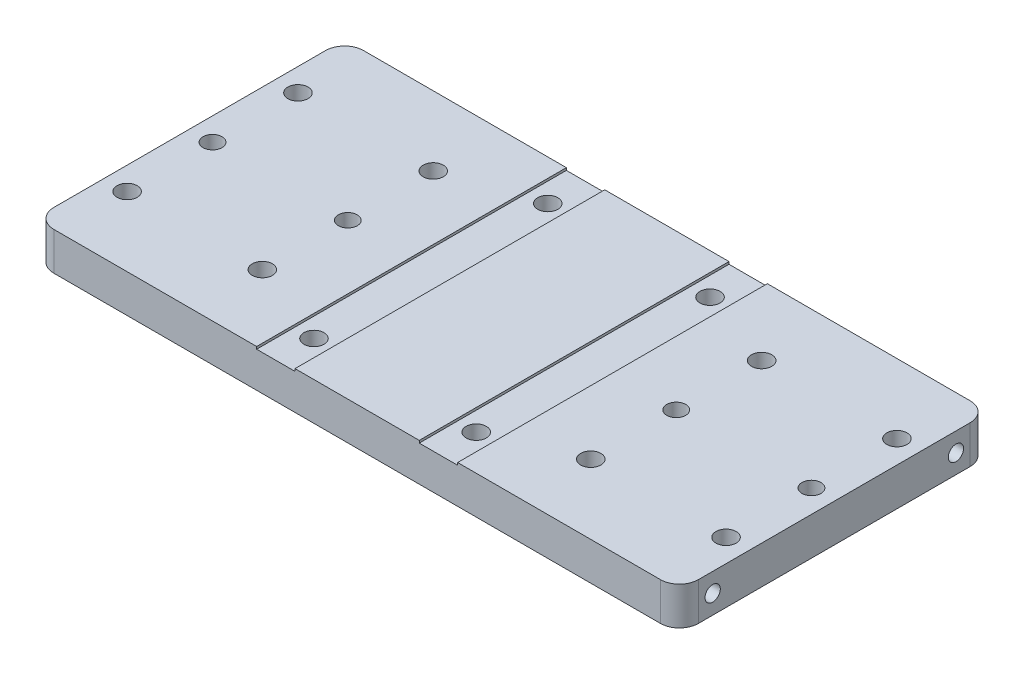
ISO-10303-21;
HEADER;
FILE_DESCRIPTION(('STEP AP214'),'2;1');
FILE_NAME('part.step','',(''),(''),'','','');
FILE_SCHEMA(('AUTOMOTIVE_DESIGN { 1 0 10303 214 1 1 1 1 }'));
ENDSEC;
DATA;
#1=APPLICATION_CONTEXT('core data for automotive mechanical design processes');
#2=APPLICATION_PROTOCOL_DEFINITION('international standard','automotive_design',2000,#1);
#3=PRODUCT_CONTEXT('',#1,'mechanical');
#4=PRODUCT('Part','Part','',(#3));
#5=PRODUCT_RELATED_PRODUCT_CATEGORY('part','',(#4));
#6=PRODUCT_DEFINITION_FORMATION('','',#4);
#7=PRODUCT_DEFINITION_CONTEXT('part definition',#1,'design');
#8=PRODUCT_DEFINITION('design','',#6,#7);
#9=PRODUCT_DEFINITION_SHAPE('','',#8);
#10=(LENGTH_UNIT() NAMED_UNIT(*) SI_UNIT(.MILLI.,.METRE.));
#11=(NAMED_UNIT(*) PLANE_ANGLE_UNIT() SI_UNIT($,.RADIAN.));
#12=(NAMED_UNIT(*) SI_UNIT($,.STERADIAN.) SOLID_ANGLE_UNIT());
#13=UNCERTAINTY_MEASURE_WITH_UNIT(LENGTH_MEASURE(1.E-05),#10,'distance_accuracy_value','');
#14=(GEOMETRIC_REPRESENTATION_CONTEXT(3) GLOBAL_UNCERTAINTY_ASSIGNED_CONTEXT((#13)) GLOBAL_UNIT_ASSIGNED_CONTEXT((#10,
#11,#12)) REPRESENTATION_CONTEXT('',''));
#15=CARTESIAN_POINT('',(0.,0.,0.));
#16=DIRECTION('',(0.,0.,1.));
#17=DIRECTION('',(1.,0.,0.));
#18=AXIS2_PLACEMENT_3D('',#15,#16,#17);
#19=CARTESIAN_POINT('',(0.,6.35,0.));
#20=DIRECTION('',(0.,1.,0.));
#21=DIRECTION('',(0.,0.,1.));
#22=AXIS2_PLACEMENT_3D('',#19,#20,#21);
#23=PLANE('',#22);
#24=CARTESIAN_POINT('',(-100.1522,6.35,0.));
#25=DIRECTION('',(0.,1.,0.));
#26=DIRECTION('',(0.,0.,1.));
#27=AXIS2_PLACEMENT_3D('',#24,#25,#26);
#28=CIRCLE('',#27,3.175);
#29=CARTESIAN_POINT('',(-100.1522,6.35,3.17500000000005));
#30=VERTEX_POINT('',#29);
#31=EDGE_CURVE('E193',#30,#30,#28,.T.);
#32=ORIENTED_EDGE('',*,*,#31,.F.);
#33=EDGE_LOOP('',(#32));
#34=FACE_BOUND('',#33,.T.);
#35=CARTESIAN_POINT('',(-54.9148,6.35,0.));
#36=DIRECTION('',(0.,1.,0.));
#37=DIRECTION('',(0.,0.,1.));
#38=AXIS2_PLACEMENT_3D('',#35,#36,#37);
#39=CIRCLE('',#38,3.175);
#40=CARTESIAN_POINT('',(-54.9148,6.35,3.17500000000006));
#41=VERTEX_POINT('',#40);
#42=EDGE_CURVE('E199',#41,#41,#39,.T.);
#43=ORIENTED_EDGE('',*,*,#42,.F.);
#44=EDGE_LOOP('',(#43));
#45=FACE_BOUND('',#44,.T.);
#46=DIRECTION('',(0.,0.,1.));
#47=VECTOR('',#46,1.);
#48=CARTESIAN_POINT('',(-107.7849,6.35,-51.7906));
#49=LINE('',#48,#47);
#50=CARTESIAN_POINT('',(-107.7849,6.35,-45.4406));
#51=VERTEX_POINT('',#50);
#52=CARTESIAN_POINT('',(-107.7849,6.35,45.4406));
#53=VERTEX_POINT('',#52);
#54=EDGE_CURVE('E413',#51,#53,#49,.T.);
#55=ORIENTED_EDGE('',*,*,#54,.T.);
#56=CARTESIAN_POINT('',(-101.4349,6.35,45.4406));
#57=DIRECTION('',(0.,1.,0.));
#58=DIRECTION('',(0.,0.,1.));
#59=AXIS2_PLACEMENT_3D('',#56,#57,#58);
#60=CIRCLE('',#59,6.35);
#61=CARTESIAN_POINT('',(-101.4349,6.35,51.7906));
#62=VERTEX_POINT('',#61);
#63=EDGE_CURVE('E458',#53,#62,#60,.T.);
#64=ORIENTED_EDGE('',*,*,#63,.T.);
#65=DIRECTION('',(1.,0.,0.));
#66=VECTOR('',#65,1.);
#67=CARTESIAN_POINT('',(-107.7849,6.35,51.7906));
#68=LINE('',#67,#66);
#69=CARTESIAN_POINT('',(-33.6042000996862,6.35000000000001,51.7906));
#70=VERTEX_POINT('',#69);
#71=EDGE_CURVE('E418',#62,#70,#68,.T.);
#72=ORIENTED_EDGE('',*,*,#71,.T.);
#73=DIRECTION('',(0.,0.,-1.));
#74=VECTOR('',#73,1.);
#75=CARTESIAN_POINT('',(-33.6042000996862,6.35000000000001,51.7906));
#76=LINE('',#75,#74);
#77=CARTESIAN_POINT('',(-33.6042000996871,6.35,-51.7906));
#78=VERTEX_POINT('',#77);
#79=EDGE_CURVE('E403',#70,#78,#76,.T.);
#80=ORIENTED_EDGE('',*,*,#79,.T.);
#81=DIRECTION('',(-1.,0.,0.));
#82=VECTOR('',#81,1.);
#83=CARTESIAN_POINT('',(-107.7849,6.35,-51.7906));
#84=LINE('',#83,#82);
#85=CARTESIAN_POINT('',(-101.4349,6.35,-51.7906));
#86=VERTEX_POINT('',#85);
#87=EDGE_CURVE('E409',#78,#86,#84,.T.);
#88=ORIENTED_EDGE('',*,*,#87,.T.);
#89=CARTESIAN_POINT('',(-101.4349,6.35,-45.4406));
#90=DIRECTION('',(0.,1.,0.));
#91=DIRECTION('',(0.,0.,1.));
#92=AXIS2_PLACEMENT_3D('',#89,#90,#91);
#93=CIRCLE('',#92,6.35);
#94=EDGE_CURVE('E456',#86,#51,#93,.T.);
#95=ORIENTED_EDGE('',*,*,#94,.T.);
#96=EDGE_LOOP('',(#55,#64,#72,#80,#88,#95));
#97=FACE_BOUND('',#96,.T.);
#98=CARTESIAN_POINT('',(-100.1522,6.35000000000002,-28.5749999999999));
#99=DIRECTION('',(0.,-1.,0.));
#100=DIRECTION('',(0.,0.,-1.));
#101=AXIS2_PLACEMENT_3D('',#98,#99,#100);
#102=CIRCLE('',#101,3.3782);
#103=CARTESIAN_POINT('',(-100.1522,6.35000000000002,-31.9531999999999));
#104=VERTEX_POINT('',#103);
#105=EDGE_CURVE('E250',#104,#104,#102,.T.);
#106=ORIENTED_EDGE('',*,*,#105,.T.);
#107=EDGE_LOOP('',(#106));
#108=FACE_BOUND('',#107,.T.);
#109=CARTESIAN_POINT('',(-100.1522,6.35000000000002,28.5750000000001));
#110=DIRECTION('',(0.,-1.,0.));
#111=DIRECTION('',(0.,0.,-1.));
#112=AXIS2_PLACEMENT_3D('',#109,#110,#111);
#113=CIRCLE('',#112,3.3782);
#114=CARTESIAN_POINT('',(-100.1522,6.35000000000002,25.1968000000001));
#115=VERTEX_POINT('',#114);
#116=EDGE_CURVE('E238',#115,#115,#113,.T.);
#117=ORIENTED_EDGE('',*,*,#116,.T.);
#118=EDGE_LOOP('',(#117));
#119=FACE_BOUND('',#118,.T.);
#120=CARTESIAN_POINT('',(-54.9148,6.35000000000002,28.5750000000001));
#121=DIRECTION('',(0.,-1.,0.));
#122=DIRECTION('',(0.,0.,-1.));
#123=AXIS2_PLACEMENT_3D('',#120,#121,#122);
#124=CIRCLE('',#123,3.3782);
#125=CARTESIAN_POINT('',(-54.9148,6.35000000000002,25.1968000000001));
#126=VERTEX_POINT('',#125);
#127=EDGE_CURVE('E226',#126,#126,#124,.T.);
#128=ORIENTED_EDGE('',*,*,#127,.T.);
#129=EDGE_LOOP('',(#128));
#130=FACE_BOUND('',#129,.T.);
#131=CARTESIAN_POINT('',(-54.9148,6.35000000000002,-28.5749999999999));
#132=DIRECTION('',(0.,-1.,0.));
#133=DIRECTION('',(0.,0.,-1.));
#134=AXIS2_PLACEMENT_3D('',#131,#132,#133);
#135=CIRCLE('',#134,3.3782);
#136=CARTESIAN_POINT('',(-54.9148,6.35000000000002,-31.9531999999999));
#137=VERTEX_POINT('',#136);
#138=EDGE_CURVE('E214',#137,#137,#135,.T.);
#139=ORIENTED_EDGE('',*,*,#138,.T.);
#140=EDGE_LOOP('',(#139));
#141=FACE_BOUND('',#140,.T.);
#142=ADVANCED_FACE('F37',(#34,#45,#97,#108,#119,#130,#141),#23,.T.);
#143=CARTESIAN_POINT('',(100.152200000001,6.35,0.));
#144=DIRECTION('',(0.,1.,0.));
#145=DIRECTION('',(0.,0.,1.));
#146=AXIS2_PLACEMENT_3D('',#143,#144,#145);
#147=CIRCLE('',#146,3.175);
#148=CARTESIAN_POINT('',(100.152200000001,6.35,3.17499999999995));
#149=VERTEX_POINT('',#148);
#150=EDGE_CURVE('E181',#149,#149,#147,.T.);
#151=ORIENTED_EDGE('',*,*,#150,.F.);
#152=EDGE_LOOP('',(#151));
#153=FACE_BOUND('',#152,.T.);
#154=CARTESIAN_POINT('',(54.9148,6.35,-1.10656453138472E-13));
#155=DIRECTION('',(0.,1.,0.));
#156=DIRECTION('',(0.,0.,1.));
#157=AXIS2_PLACEMENT_3D('',#154,#155,#156);
#158=CIRCLE('',#157,3.175);
#159=CARTESIAN_POINT('',(54.9148,6.35,3.17499999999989));
#160=VERTEX_POINT('',#159);
#161=EDGE_CURVE('E187',#160,#160,#158,.T.);
#162=ORIENTED_EDGE('',*,*,#161,.F.);
#163=EDGE_LOOP('',(#162));
#164=FACE_BOUND('',#163,.T.);
#165=DIRECTION('',(0.,0.,-1.));
#166=VECTOR('',#165,1.);
#167=CARTESIAN_POINT('',(107.7849,6.35,-51.7906));
#168=LINE('',#167,#166);
#169=CARTESIAN_POINT('',(107.7849,6.35,45.4406));
#170=VERTEX_POINT('',#169);
#171=CARTESIAN_POINT('',(107.7849,6.35,-45.4406));
#172=VERTEX_POINT('',#171);
#173=EDGE_CURVE('E407',#170,#172,#168,.T.);
#174=ORIENTED_EDGE('',*,*,#173,.T.);
#175=CARTESIAN_POINT('',(101.4349,6.35,-45.4406));
#176=DIRECTION('',(0.,1.,0.));
#177=DIRECTION('',(0.,0.,1.));
#178=AXIS2_PLACEMENT_3D('',#175,#176,#177);
#179=CIRCLE('',#178,6.35);
#180=CARTESIAN_POINT('',(101.4349,6.35,-51.7906));
#181=VERTEX_POINT('',#180);
#182=EDGE_CURVE('E11',#172,#181,#179,.T.);
#183=ORIENTED_EDGE('',*,*,#182,.T.);
#184=CARTESIAN_POINT('',(33.6042000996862,6.35,-51.7906));
#185=VERTEX_POINT('',#184);
#186=EDGE_CURVE('E411',#181,#185,#84,.T.);
#187=ORIENTED_EDGE('',*,*,#186,.T.);
#188=DIRECTION('',(0.,0.,-1.));
#189=VECTOR('',#188,1.);
#190=CARTESIAN_POINT('',(33.6042000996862,6.35,51.7906));
#191=LINE('',#190,#189);
#192=CARTESIAN_POINT('',(33.6042000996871,6.35,51.7906));
#193=VERTEX_POINT('',#192);
#194=EDGE_CURVE('E377',#193,#185,#191,.T.);
#195=ORIENTED_EDGE('',*,*,#194,.F.);
#196=CARTESIAN_POINT('',(101.4349,6.35,51.7906));
#197=VERTEX_POINT('',#196);
#198=EDGE_CURVE('E417',#193,#197,#68,.T.);
#199=ORIENTED_EDGE('',*,*,#198,.T.);
#200=CARTESIAN_POINT('',(101.4349,6.35,45.4406));
#201=DIRECTION('',(0.,1.,0.));
#202=DIRECTION('',(0.,0.,1.));
#203=AXIS2_PLACEMENT_3D('',#200,#201,#202);
#204=CIRCLE('',#203,6.35);
#205=EDGE_CURVE('E45',#197,#170,#204,.T.);
#206=ORIENTED_EDGE('',*,*,#205,.T.);
#207=EDGE_LOOP('',(#174,#183,#187,#195,#199,#206));
#208=FACE_BOUND('',#207,.T.);
#209=CARTESIAN_POINT('',(54.9148,6.35000000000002,-28.5750000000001));
#210=DIRECTION('',(0.,-1.,0.));
#211=DIRECTION('',(0.,0.,-1.));
#212=AXIS2_PLACEMENT_3D('',#209,#210,#211);
#213=CIRCLE('',#212,3.3782);
#214=CARTESIAN_POINT('',(54.9148,6.35000000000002,-31.9532000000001));
#215=VERTEX_POINT('',#214);
#216=EDGE_CURVE('E298',#215,#215,#213,.T.);
#217=ORIENTED_EDGE('',*,*,#216,.T.);
#218=EDGE_LOOP('',(#217));
#219=FACE_BOUND('',#218,.T.);
#220=CARTESIAN_POINT('',(54.9148,6.35000000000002,28.5749999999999));
#221=DIRECTION('',(0.,-1.,0.));
#222=DIRECTION('',(0.,0.,-1.));
#223=AXIS2_PLACEMENT_3D('',#220,#221,#222);
#224=CIRCLE('',#223,3.3782);
#225=CARTESIAN_POINT('',(54.9148,6.35000000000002,25.1967999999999));
#226=VERTEX_POINT('',#225);
#227=EDGE_CURVE('E286',#226,#226,#224,.T.);
#228=ORIENTED_EDGE('',*,*,#227,.T.);
#229=EDGE_LOOP('',(#228));
#230=FACE_BOUND('',#229,.T.);
#231=CARTESIAN_POINT('',(100.152200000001,6.35000000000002,-28.575));
#232=DIRECTION('',(0.,-1.,0.));
#233=DIRECTION('',(0.,0.,-1.));
#234=AXIS2_PLACEMENT_3D('',#231,#232,#233);
#235=CIRCLE('',#234,3.3782);
#236=CARTESIAN_POINT('',(100.152200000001,6.35000000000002,-31.9532));
#237=VERTEX_POINT('',#236);
#238=EDGE_CURVE('E274',#237,#237,#235,.T.);
#239=ORIENTED_EDGE('',*,*,#238,.T.);
#240=EDGE_LOOP('',(#239));
#241=FACE_BOUND('',#240,.T.);
#242=CARTESIAN_POINT('',(100.152200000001,6.35000000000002,28.575));
#243=DIRECTION('',(0.,-1.,0.));
#244=DIRECTION('',(0.,0.,-1.));
#245=AXIS2_PLACEMENT_3D('',#242,#243,#244);
#246=CIRCLE('',#245,3.3782);
#247=CARTESIAN_POINT('',(100.152200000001,6.35000000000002,25.1968));
#248=VERTEX_POINT('',#247);
#249=EDGE_CURVE('E262',#248,#248,#246,.T.);
#250=ORIENTED_EDGE('',*,*,#249,.T.);
#251=EDGE_LOOP('',(#250));
#252=FACE_BOUND('',#251,.T.);
#253=ADVANCED_FACE('F488',(#153,#164,#208,#219,#230,#241,#252),#23,.T.);
#254=CARTESIAN_POINT('',(0.,-6.35,0.));
#255=DIRECTION('',(0.,1.,0.));
#256=DIRECTION('',(0.,0.,1.));
#257=AXIS2_PLACEMENT_3D('',#254,#255,#256);
#258=PLANE('',#257);
#259=CARTESIAN_POINT('',(100.152200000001,-6.35,0.));
#260=DIRECTION('',(0.,1.,0.));
#261=DIRECTION('',(0.,0.,1.));
#262=AXIS2_PLACEMENT_3D('',#259,#260,#261);
#263=CIRCLE('',#262,3.175);
#264=CARTESIAN_POINT('',(100.152200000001,-6.35,3.17499999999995));
#265=VERTEX_POINT('',#264);
#266=EDGE_CURVE('E184',#265,#265,#263,.T.);
#267=ORIENTED_EDGE('',*,*,#266,.T.);
#268=EDGE_LOOP('',(#267));
#269=FACE_BOUND('',#268,.T.);
#270=CARTESIAN_POINT('',(54.9148,-6.35,-1.10656453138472E-13));
#271=DIRECTION('',(0.,1.,0.));
#272=DIRECTION('',(0.,0.,1.));
#273=AXIS2_PLACEMENT_3D('',#270,#271,#272);
#274=CIRCLE('',#273,3.175);
#275=CARTESIAN_POINT('',(54.9148,-6.35,3.17499999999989));
#276=VERTEX_POINT('',#275);
#277=EDGE_CURVE('E190',#276,#276,#274,.T.);
#278=ORIENTED_EDGE('',*,*,#277,.T.);
#279=EDGE_LOOP('',(#278));
#280=FACE_BOUND('',#279,.T.);
#281=CARTESIAN_POINT('',(-100.1522,-6.35,0.));
#282=DIRECTION('',(0.,1.,0.));
#283=DIRECTION('',(0.,0.,1.));
#284=AXIS2_PLACEMENT_3D('',#281,#282,#283);
#285=CIRCLE('',#284,3.175);
#286=CARTESIAN_POINT('',(-100.1522,-6.35,3.17500000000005));
#287=VERTEX_POINT('',#286);
#288=EDGE_CURVE('E196',#287,#287,#285,.T.);
#289=ORIENTED_EDGE('',*,*,#288,.T.);
#290=EDGE_LOOP('',(#289));
#291=FACE_BOUND('',#290,.T.);
#292=CARTESIAN_POINT('',(-54.9148,-6.35,0.));
#293=DIRECTION('',(0.,1.,0.));
#294=DIRECTION('',(0.,0.,1.));
#295=AXIS2_PLACEMENT_3D('',#292,#293,#294);
#296=CIRCLE('',#295,3.175);
#297=CARTESIAN_POINT('',(-54.9148,-6.35,3.17500000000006));
#298=VERTEX_POINT('',#297);
#299=EDGE_CURVE('E202',#298,#298,#296,.T.);
#300=ORIENTED_EDGE('',*,*,#299,.T.);
#301=EDGE_LOOP('',(#300));
#302=FACE_BOUND('',#301,.T.);
#303=CARTESIAN_POINT('',(-54.9148,-6.35,-28.5749999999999));
#304=DIRECTION('',(0.,-1.,0.));
#305=DIRECTION('',(0.,0.,-1.));
#306=AXIS2_PLACEMENT_3D('',#303,#304,#305);
#307=CIRCLE('',#306,5.55625);
#308=CARTESIAN_POINT('',(-54.9148,-6.35,-34.1312499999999));
#309=VERTEX_POINT('',#308);
#310=EDGE_CURVE('E205',#309,#309,#307,.T.);
#311=ORIENTED_EDGE('',*,*,#310,.F.);
#312=EDGE_LOOP('',(#311));
#313=FACE_BOUND('',#312,.T.);
#314=CARTESIAN_POINT('',(-54.9148,-6.35,28.5750000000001));
#315=DIRECTION('',(0.,-1.,0.));
#316=DIRECTION('',(0.,0.,-1.));
#317=AXIS2_PLACEMENT_3D('',#314,#315,#316);
#318=CIRCLE('',#317,5.55625);
#319=CARTESIAN_POINT('',(-54.9148,-6.35,23.0187500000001));
#320=VERTEX_POINT('',#319);
#321=EDGE_CURVE('E217',#320,#320,#318,.T.);
#322=ORIENTED_EDGE('',*,*,#321,.F.);
#323=EDGE_LOOP('',(#322));
#324=FACE_BOUND('',#323,.T.);
#325=CARTESIAN_POINT('',(-100.1522,-6.35,28.5750000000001));
#326=DIRECTION('',(0.,-1.,0.));
#327=DIRECTION('',(0.,0.,-1.));
#328=AXIS2_PLACEMENT_3D('',#325,#326,#327);
#329=CIRCLE('',#328,5.55625);
#330=CARTESIAN_POINT('',(-100.1522,-6.35,23.0187500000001));
#331=VERTEX_POINT('',#330);
#332=EDGE_CURVE('E229',#331,#331,#329,.T.);
#333=ORIENTED_EDGE('',*,*,#332,.F.);
#334=EDGE_LOOP('',(#333));
#335=FACE_BOUND('',#334,.T.);
#336=CARTESIAN_POINT('',(-100.1522,-6.35,-28.5749999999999));
#337=DIRECTION('',(0.,-1.,0.));
#338=DIRECTION('',(0.,0.,-1.));
#339=AXIS2_PLACEMENT_3D('',#336,#337,#338);
#340=CIRCLE('',#339,5.55625);
#341=CARTESIAN_POINT('',(-100.1522,-6.35,-34.1312499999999));
#342=VERTEX_POINT('',#341);
#343=EDGE_CURVE('E241',#342,#342,#340,.T.);
#344=ORIENTED_EDGE('',*,*,#343,.F.);
#345=EDGE_LOOP('',(#344));
#346=FACE_BOUND('',#345,.T.);
#347=CARTESIAN_POINT('',(100.152200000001,-6.35,28.575));
#348=DIRECTION('',(0.,-1.,0.));
#349=DIRECTION('',(0.,0.,-1.));
#350=AXIS2_PLACEMENT_3D('',#347,#348,#349);
#351=CIRCLE('',#350,5.55625);
#352=CARTESIAN_POINT('',(100.152200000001,-6.35,23.01875));
#353=VERTEX_POINT('',#352);
#354=EDGE_CURVE('E253',#353,#353,#351,.T.);
#355=ORIENTED_EDGE('',*,*,#354,.F.);
#356=EDGE_LOOP('',(#355));
#357=FACE_BOUND('',#356,.T.);
#358=CARTESIAN_POINT('',(100.152200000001,-6.35,-28.575));
#359=DIRECTION('',(0.,-1.,0.));
#360=DIRECTION('',(0.,0.,-1.));
#361=AXIS2_PLACEMENT_3D('',#358,#359,#360);
#362=CIRCLE('',#361,5.55625);
#363=CARTESIAN_POINT('',(100.152200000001,-6.35,-34.13125));
#364=VERTEX_POINT('',#363);
#365=EDGE_CURVE('E265',#364,#364,#362,.T.);
#366=ORIENTED_EDGE('',*,*,#365,.F.);
#367=EDGE_LOOP('',(#366));
#368=FACE_BOUND('',#367,.T.);
#369=CARTESIAN_POINT('',(54.9148,-6.35,-28.5750000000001));
#370=DIRECTION('',(0.,-1.,0.));
#371=DIRECTION('',(0.,0.,-1.));
#372=AXIS2_PLACEMENT_3D('',#369,#370,#371);
#373=CIRCLE('',#372,5.55625);
#374=CARTESIAN_POINT('',(54.9148,-6.35,-34.1312500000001));
#375=VERTEX_POINT('',#374);
#376=EDGE_CURVE('E289',#375,#375,#373,.T.);
#377=ORIENTED_EDGE('',*,*,#376,.F.);
#378=EDGE_LOOP('',(#377));
#379=FACE_BOUND('',#378,.T.);
#380=CARTESIAN_POINT('',(-27.1272,-6.35,-39.0905999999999));
#381=DIRECTION('',(0.,-1.,0.));
#382=DIRECTION('',(0.,0.,-1.));
#383=AXIS2_PLACEMENT_3D('',#380,#381,#382);
#384=CIRCLE('',#383,5.55625);
#385=CARTESIAN_POINT('',(-27.1272,-6.35,-44.6468499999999));
#386=VERTEX_POINT('',#385);
#387=EDGE_CURVE('E313',#386,#386,#384,.T.);
#388=ORIENTED_EDGE('',*,*,#387,.F.);
#389=EDGE_LOOP('',(#388));
#390=FACE_BOUND('',#389,.T.);
#391=CARTESIAN_POINT('',(-27.1271999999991,-6.35,39.0906));
#392=DIRECTION('',(0.,-1.,0.));
#393=DIRECTION('',(0.,0.,-1.));
#394=AXIS2_PLACEMENT_3D('',#391,#392,#393);
#395=CIRCLE('',#394,5.55625);
#396=CARTESIAN_POINT('',(-27.1271999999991,-6.35,33.53435));
#397=VERTEX_POINT('',#396);
#398=EDGE_CURVE('E323',#397,#397,#395,.T.);
#399=ORIENTED_EDGE('',*,*,#398,.F.);
#400=EDGE_LOOP('',(#399));
#401=FACE_BOUND('',#400,.T.);
#402=CARTESIAN_POINT('',(27.1271999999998,-6.35,39.0906000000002));
#403=DIRECTION('',(0.,-1.,0.));
#404=DIRECTION('',(0.,0.,-1.));
#405=AXIS2_PLACEMENT_3D('',#402,#403,#404);
#406=CIRCLE('',#405,5.55625);
#407=CARTESIAN_POINT('',(27.1271999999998,-6.35,33.5343500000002));
#408=VERTEX_POINT('',#407);
#409=EDGE_CURVE('E333',#408,#408,#406,.T.);
#410=ORIENTED_EDGE('',*,*,#409,.F.);
#411=EDGE_LOOP('',(#410));
#412=FACE_BOUND('',#411,.T.);
#413=CARTESIAN_POINT('',(27.1271999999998,-6.35,-39.0905999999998));
#414=DIRECTION('',(0.,-1.,0.));
#415=DIRECTION('',(0.,0.,-1.));
#416=AXIS2_PLACEMENT_3D('',#413,#414,#415);
#417=CIRCLE('',#416,5.55625);
#418=CARTESIAN_POINT('',(27.1271999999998,-6.35,-44.6468499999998));
#419=VERTEX_POINT('',#418);
#420=EDGE_CURVE('E343',#419,#419,#417,.T.);
#421=ORIENTED_EDGE('',*,*,#420,.F.);
#422=EDGE_LOOP('',(#421));
#423=FACE_BOUND('',#422,.T.);
#424=DIRECTION('',(1.,0.,0.));
#425=VECTOR('',#424,1.);
#426=CARTESIAN_POINT('',(-107.7849,-6.35,51.7906));
#427=LINE('',#426,#425);
#428=CARTESIAN_POINT('',(-101.4349,-6.35,51.7906));
#429=VERTEX_POINT('',#428);
#430=CARTESIAN_POINT('',(101.4349,-6.35,51.7906));
#431=VERTEX_POINT('',#430);
#432=EDGE_CURVE('E410',#429,#431,#427,.T.);
#433=ORIENTED_EDGE('',*,*,#432,.F.);
#434=CARTESIAN_POINT('',(-101.4349,-6.35,45.4406));
#435=DIRECTION('',(0.,1.,0.));
#436=DIRECTION('',(0.,0.,1.));
#437=AXIS2_PLACEMENT_3D('',#434,#435,#436);
#438=CIRCLE('',#437,6.35);
#439=CARTESIAN_POINT('',(-107.7849,-6.35,45.4406));
#440=VERTEX_POINT('',#439);
#441=EDGE_CURVE('E449',#429,#440,#438,.F.);
#442=ORIENTED_EDGE('',*,*,#441,.T.);
#443=DIRECTION('',(0.,0.,1.));
#444=VECTOR('',#443,1.);
#445=CARTESIAN_POINT('',(-107.7849,-6.35,-51.7906));
#446=LINE('',#445,#444);
#447=CARTESIAN_POINT('',(-107.7849,-6.35,-45.4406));
#448=VERTEX_POINT('',#447);
#449=EDGE_CURVE('E426',#448,#440,#446,.T.);
#450=ORIENTED_EDGE('',*,*,#449,.F.);
#451=CARTESIAN_POINT('',(-101.4349,-6.35,-45.4406));
#452=DIRECTION('',(0.,1.,0.));
#453=DIRECTION('',(0.,0.,1.));
#454=AXIS2_PLACEMENT_3D('',#451,#452,#453);
#455=CIRCLE('',#454,6.35);
#456=CARTESIAN_POINT('',(-101.4349,-6.35,-51.7906));
#457=VERTEX_POINT('',#456);
#458=EDGE_CURVE('E447',#448,#457,#455,.F.);
#459=ORIENTED_EDGE('',*,*,#458,.T.);
#460=DIRECTION('',(-1.,0.,0.));
#461=VECTOR('',#460,1.);
#462=CARTESIAN_POINT('',(-107.7849,-6.35,-51.7906));
#463=LINE('',#462,#461);
#464=CARTESIAN_POINT('',(101.4349,-6.35,-51.7906));
#465=VERTEX_POINT('',#464);
#466=EDGE_CURVE('E423',#465,#457,#463,.T.);
#467=ORIENTED_EDGE('',*,*,#466,.F.);
#468=CARTESIAN_POINT('',(101.4349,-6.35,-45.4406));
#469=DIRECTION('',(0.,1.,0.));
#470=DIRECTION('',(0.,0.,1.));
#471=AXIS2_PLACEMENT_3D('',#468,#469,#470);
#472=CIRCLE('',#471,6.35);
#473=CARTESIAN_POINT('',(107.7849,-6.35,-45.4406));
#474=VERTEX_POINT('',#473);
#475=EDGE_CURVE('E445',#465,#474,#472,.F.);
#476=ORIENTED_EDGE('',*,*,#475,.T.);
#477=DIRECTION('',(0.,0.,-1.));
#478=VECTOR('',#477,1.);
#479=CARTESIAN_POINT('',(107.7849,-6.35,-51.7906));
#480=LINE('',#479,#478);
#481=CARTESIAN_POINT('',(107.7849,-6.35,45.4406));
#482=VERTEX_POINT('',#481);
#483=EDGE_CURVE('E374',#482,#474,#480,.T.);
#484=ORIENTED_EDGE('',*,*,#483,.F.);
#485=CARTESIAN_POINT('',(101.4349,-6.35,45.4406));
#486=DIRECTION('',(0.,1.,0.));
#487=DIRECTION('',(0.,0.,1.));
#488=AXIS2_PLACEMENT_3D('',#485,#486,#487);
#489=CIRCLE('',#488,6.35);
#490=EDGE_CURVE('E443',#482,#431,#489,.F.);
#491=ORIENTED_EDGE('',*,*,#490,.T.);
#492=EDGE_LOOP('',(#433,#442,#450,#459,#467,#476,#484,#491));
#493=FACE_BOUND('',#492,.T.);
#494=CARTESIAN_POINT('',(54.9148,-6.35,28.5749999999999));
#495=DIRECTION('',(0.,-1.,0.));
#496=DIRECTION('',(0.,0.,-1.));
#497=AXIS2_PLACEMENT_3D('',#494,#495,#496);
#498=CIRCLE('',#497,5.55625);
#499=CARTESIAN_POINT('',(54.9148,-6.35,23.0187499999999));
#500=VERTEX_POINT('',#499);
#501=EDGE_CURVE('E277',#500,#500,#498,.T.);
#502=ORIENTED_EDGE('',*,*,#501,.F.);
#503=EDGE_LOOP('',(#502));
#504=FACE_BOUND('',#503,.T.);
#505=ADVANCED_FACE('F474',(#269,#280,#291,#302,#313,#324,#335,#346,#357,#368,#379,#390,#401,
#412,#423,#493,#504),#258,.F.);
#506=DIRECTION('',(0.,0.,-1.));
#507=VECTOR('',#506,1.);
#508=CARTESIAN_POINT('',(20.7772000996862,6.35,51.7906));
#509=LINE('',#508,#507);
#510=CARTESIAN_POINT('',(20.7772000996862,6.35,51.7906));
#511=VERTEX_POINT('',#510);
#512=CARTESIAN_POINT('',(20.7772000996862,6.35,-51.7906));
#513=VERTEX_POINT('',#512);
#514=EDGE_CURVE('E363',#511,#513,#509,.T.);
#515=ORIENTED_EDGE('',*,*,#514,.T.);
#516=CARTESIAN_POINT('',(-20.7772000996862,6.35,-51.7906));
#517=VERTEX_POINT('',#516);
#518=EDGE_CURVE('E414',#513,#517,#84,.T.);
#519=ORIENTED_EDGE('',*,*,#518,.T.);
#520=DIRECTION('',(0.,0.,-1.));
#521=VECTOR('',#520,1.);
#522=CARTESIAN_POINT('',(-20.7772000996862,6.35,51.7906));
#523=LINE('',#522,#521);
#524=CARTESIAN_POINT('',(-20.7772000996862,6.35,51.7906));
#525=VERTEX_POINT('',#524);
#526=EDGE_CURVE('E401',#525,#517,#523,.T.);
#527=ORIENTED_EDGE('',*,*,#526,.F.);
#528=EDGE_CURVE('E421',#525,#511,#68,.T.);
#529=ORIENTED_EDGE('',*,*,#528,.T.);
#530=EDGE_LOOP('',(#515,#519,#527,#529));
#531=FACE_BOUND('',#530,.T.);
#532=ADVANCED_FACE('F502',(#531),#23,.T.);
#533=CARTESIAN_POINT('',(107.7849,6.35,-51.7906));
#534=DIRECTION('',(-1.,0.,0.));
#535=DIRECTION('',(0.,0.,1.));
#536=AXIS2_PLACEMENT_3D('',#533,#534,#535);
#537=PLANE('',#536);
#538=CARTESIAN_POINT('',(107.7849,0.,40.6781));
#539=DIRECTION('',(1.,0.,0.));
#540=DIRECTION('',(0.,0.,-1.));
#541=AXIS2_PLACEMENT_3D('',#538,#539,#540);
#542=CIRCLE('',#541,2.55269999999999);
#543=CARTESIAN_POINT('',(107.7849,0.,38.1254));
#544=VERTEX_POINT('',#543);
#545=EDGE_CURVE('E301',#544,#544,#542,.T.);
#546=ORIENTED_EDGE('',*,*,#545,.F.);
#547=EDGE_LOOP('',(#546));
#548=FACE_BOUND('',#547,.T.);
#549=CARTESIAN_POINT('',(107.7849,0.,-40.6781));
#550=DIRECTION('',(1.,0.,0.));
#551=DIRECTION('',(0.,0.,-1.));
#552=AXIS2_PLACEMENT_3D('',#549,#550,#551);
#553=CIRCLE('',#552,2.55269999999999);
#554=CARTESIAN_POINT('',(107.7849,0.,-43.2308));
#555=VERTEX_POINT('',#554);
#556=EDGE_CURVE('E307',#555,#555,#553,.T.);
#557=ORIENTED_EDGE('',*,*,#556,.F.);
#558=EDGE_LOOP('',(#557));
#559=FACE_BOUND('',#558,.T.);
#560=ORIENTED_EDGE('',*,*,#483,.T.);
#561=DIRECTION('',(0.,-1.,0.));
#562=VECTOR('',#561,1.);
#563=CARTESIAN_POINT('',(107.7849,6.35,-45.4406));
#564=LINE('',#563,#562);
#565=EDGE_CURVE('E52',#474,#172,#564,.F.);
#566=ORIENTED_EDGE('',*,*,#565,.T.);
#567=ORIENTED_EDGE('',*,*,#173,.F.);
#568=DIRECTION('',(0.,-1.,0.));
#569=VECTOR('',#568,1.);
#570=CARTESIAN_POINT('',(107.7849,6.35,45.4406));
#571=LINE('',#570,#569);
#572=EDGE_CURVE('E465',#170,#482,#571,.T.);
#573=ORIENTED_EDGE('',*,*,#572,.T.);
#574=EDGE_LOOP('',(#560,#566,#567,#573));
#575=FACE_BOUND('',#574,.T.);
#576=ADVANCED_FACE('F470',(#548,#559,#575),#537,.F.);
#577=CARTESIAN_POINT('',(-107.7849,6.35,-51.7906));
#578=DIRECTION('',(0.,0.,1.));
#579=DIRECTION('',(1.,0.,0.));
#580=AXIS2_PLACEMENT_3D('',#577,#578,#579);
#581=PLANE('',#580);
#582=ORIENTED_EDGE('',*,*,#466,.T.);
#583=DIRECTION('',(0.,-1.,0.));
#584=VECTOR('',#583,1.);
#585=CARTESIAN_POINT('',(-101.4349,6.35,-51.7906));
#586=LINE('',#585,#584);
#587=EDGE_CURVE('E463',#457,#86,#586,.F.);
#588=ORIENTED_EDGE('',*,*,#587,.T.);
#589=ORIENTED_EDGE('',*,*,#87,.F.);
#590=DIRECTION('',(1.11229826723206E-12,1.,0.));
#591=VECTOR('',#590,1.);
#592=CARTESIAN_POINT('',(-33.6042000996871,5.5514925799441,-51.7906));
#593=LINE('',#592,#591);
#594=CARTESIAN_POINT('',(-33.6042000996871,5.5514925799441,-51.7906));
#595=VERTEX_POINT('',#594);
#596=EDGE_CURVE('E396',#595,#78,#593,.T.);
#597=ORIENTED_EDGE('',*,*,#596,.F.);
#598=DIRECTION('',(-1.,0.,0.));
#599=VECTOR('',#598,1.);
#600=CARTESIAN_POINT('',(-20.7772000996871,5.5514925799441,-51.7906));
#601=LINE('',#600,#599);
#602=CARTESIAN_POINT('',(-20.7772000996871,5.5514925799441,-51.7906));
#603=VERTEX_POINT('',#602);
#604=EDGE_CURVE('E393',#603,#595,#601,.T.);
#605=ORIENTED_EDGE('',*,*,#604,.F.);
#606=DIRECTION('',(-1.11229826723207E-12,-1.,0.));
#607=VECTOR('',#606,1.);
#608=CARTESIAN_POINT('',(-20.7772000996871,5.5514925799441,-51.7906));
#609=LINE('',#608,#607);
#610=EDGE_CURVE('E386',#517,#603,#609,.T.);
#611=ORIENTED_EDGE('',*,*,#610,.F.);
#612=ORIENTED_EDGE('',*,*,#518,.F.);
#613=DIRECTION('',(-1.11229826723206E-12,1.,0.));
#614=VECTOR('',#613,1.);
#615=CARTESIAN_POINT('',(20.7772000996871,5.5514925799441,-51.7906));
#616=LINE('',#615,#614);
#617=CARTESIAN_POINT('',(20.7772000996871,5.5514925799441,-51.7906));
#618=VERTEX_POINT('',#617);
#619=EDGE_CURVE('E364',#618,#513,#616,.T.);
#620=ORIENTED_EDGE('',*,*,#619,.F.);
#621=DIRECTION('',(-1.,0.,0.));
#622=VECTOR('',#621,1.);
#623=CARTESIAN_POINT('',(20.7772000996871,5.5514925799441,-51.7906));
#624=LINE('',#623,#622);
#625=CARTESIAN_POINT('',(33.6042000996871,5.5514925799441,-51.7906));
#626=VERTEX_POINT('',#625);
#627=EDGE_CURVE('E357',#626,#618,#624,.T.);
#628=ORIENTED_EDGE('',*,*,#627,.F.);
#629=DIRECTION('',(1.11229826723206E-12,-1.,0.));
#630=VECTOR('',#629,1.);
#631=CARTESIAN_POINT('',(33.6042000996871,5.5514925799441,-51.7906));
#632=LINE('',#631,#630);
#633=EDGE_CURVE('E366',#185,#626,#632,.T.);
#634=ORIENTED_EDGE('',*,*,#633,.F.);
#635=ORIENTED_EDGE('',*,*,#186,.F.);
#636=DIRECTION('',(0.,-1.,0.));
#637=VECTOR('',#636,1.);
#638=CARTESIAN_POINT('',(101.4349,6.35,-51.7906));
#639=LINE('',#638,#637);
#640=EDGE_CURVE('E460',#181,#465,#639,.T.);
#641=ORIENTED_EDGE('',*,*,#640,.T.);
#642=EDGE_LOOP('',(#582,#588,#589,#597,#605,#611,#612,#620,#628,#634,#635,#641));
#643=FACE_BOUND('',#642,.T.);
#644=ADVANCED_FACE('F483',(#643),#581,.F.);
#645=CARTESIAN_POINT('',(-107.7849,6.35,-51.7906));
#646=DIRECTION('',(1.,0.,0.));
#647=DIRECTION('',(0.,0.,-1.));
#648=AXIS2_PLACEMENT_3D('',#645,#646,#647);
#649=PLANE('',#648);
#650=CARTESIAN_POINT('',(-107.7849,0.,40.6781));
#651=DIRECTION('',(-1.,0.,0.));
#652=DIRECTION('',(0.,0.,1.));
#653=AXIS2_PLACEMENT_3D('',#650,#651,#652);
#654=CIRCLE('',#653,2.55269999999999);
#655=CARTESIAN_POINT('',(-107.7849,0.,43.2308));
#656=VERTEX_POINT('',#655);
#657=EDGE_CURVE('E171',#656,#656,#654,.T.);
#658=ORIENTED_EDGE('',*,*,#657,.F.);
#659=EDGE_LOOP('',(#658));
#660=FACE_BOUND('',#659,.T.);
#661=CARTESIAN_POINT('',(-107.7849,0.,-40.6781));
#662=DIRECTION('',(-1.,0.,0.));
#663=DIRECTION('',(0.,0.,1.));
#664=AXIS2_PLACEMENT_3D('',#661,#662,#663);
#665=CIRCLE('',#664,2.55269999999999);
#666=CARTESIAN_POINT('',(-107.7849,0.,-38.1254));
#667=VERTEX_POINT('',#666);
#668=EDGE_CURVE('E170',#667,#667,#665,.T.);
#669=ORIENTED_EDGE('',*,*,#668,.F.);
#670=EDGE_LOOP('',(#669));
#671=FACE_BOUND('',#670,.T.);
#672=ORIENTED_EDGE('',*,*,#449,.T.);
#673=DIRECTION('',(0.,-1.,0.));
#674=VECTOR('',#673,1.);
#675=CARTESIAN_POINT('',(-107.7849,6.35,45.4406));
#676=LINE('',#675,#674);
#677=EDGE_CURVE('E454',#440,#53,#676,.F.);
#678=ORIENTED_EDGE('',*,*,#677,.T.);
#679=ORIENTED_EDGE('',*,*,#54,.F.);
#680=DIRECTION('',(0.,-1.,0.));
#681=VECTOR('',#680,1.);
#682=CARTESIAN_POINT('',(-107.7849,6.35,-45.4406));
#683=LINE('',#682,#681);
#684=EDGE_CURVE('E451',#51,#448,#683,.T.);
#685=ORIENTED_EDGE('',*,*,#684,.T.);
#686=EDGE_LOOP('',(#672,#678,#679,#685));
#687=FACE_BOUND('',#686,.T.);
#688=ADVANCED_FACE('F524',(#660,#671,#687),#649,.F.);
#689=CARTESIAN_POINT('',(-107.7849,6.35,51.7906));
#690=DIRECTION('',(0.,0.,-1.));
#691=DIRECTION('',(-1.,0.,0.));
#692=AXIS2_PLACEMENT_3D('',#689,#690,#691);
#693=PLANE('',#692);
#694=ORIENTED_EDGE('',*,*,#71,.F.);
#695=DIRECTION('',(0.,-1.,0.));
#696=VECTOR('',#695,1.);
#697=CARTESIAN_POINT('',(-101.4349,6.35,51.7906));
#698=LINE('',#697,#696);
#699=EDGE_CURVE('E440',#62,#429,#698,.T.);
#700=ORIENTED_EDGE('',*,*,#699,.T.);
#701=ORIENTED_EDGE('',*,*,#432,.T.);
#702=DIRECTION('',(0.,-1.,0.));
#703=VECTOR('',#702,1.);
#704=CARTESIAN_POINT('',(101.4349,6.35,51.7906));
#705=LINE('',#704,#703);
#706=EDGE_CURVE('E420',#431,#197,#705,.F.);
#707=ORIENTED_EDGE('',*,*,#706,.T.);
#708=ORIENTED_EDGE('',*,*,#198,.F.);
#709=DIRECTION('',(1.11229826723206E-12,-1.,0.));
#710=VECTOR('',#709,1.);
#711=CARTESIAN_POINT('',(33.6042000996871,5.5514925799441,51.7906));
#712=LINE('',#711,#710);
#713=CARTESIAN_POINT('',(33.6042000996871,5.5514925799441,51.7906));
#714=VERTEX_POINT('',#713);
#715=EDGE_CURVE('E356',#193,#714,#712,.T.);
#716=ORIENTED_EDGE('',*,*,#715,.T.);
#717=DIRECTION('',(-1.,0.,0.));
#718=VECTOR('',#717,1.);
#719=CARTESIAN_POINT('',(20.7772000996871,5.5514925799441,51.7906));
#720=LINE('',#719,#718);
#721=CARTESIAN_POINT('',(20.7772000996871,5.5514925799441,51.7906));
#722=VERTEX_POINT('',#721);
#723=EDGE_CURVE('E360',#714,#722,#720,.T.);
#724=ORIENTED_EDGE('',*,*,#723,.T.);
#725=DIRECTION('',(-1.11229826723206E-12,1.,0.));
#726=VECTOR('',#725,1.);
#727=CARTESIAN_POINT('',(20.7772000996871,5.5514925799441,51.7906));
#728=LINE('',#727,#726);
#729=EDGE_CURVE('E353',#722,#511,#728,.T.);
#730=ORIENTED_EDGE('',*,*,#729,.T.);
#731=ORIENTED_EDGE('',*,*,#528,.F.);
#732=DIRECTION('',(-1.11229826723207E-12,-1.,0.));
#733=VECTOR('',#732,1.);
#734=CARTESIAN_POINT('',(-20.7772000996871,5.5514925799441,51.7906));
#735=LINE('',#734,#733);
#736=CARTESIAN_POINT('',(-20.7772000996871,5.5514925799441,51.7906));
#737=VERTEX_POINT('',#736);
#738=EDGE_CURVE('E389',#525,#737,#735,.T.);
#739=ORIENTED_EDGE('',*,*,#738,.T.);
#740=DIRECTION('',(-1.,0.,0.));
#741=VECTOR('',#740,1.);
#742=CARTESIAN_POINT('',(-20.7772000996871,5.5514925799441,51.7906));
#743=LINE('',#742,#741);
#744=CARTESIAN_POINT('',(-33.6042000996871,5.5514925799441,51.7906));
#745=VERTEX_POINT('',#744);
#746=EDGE_CURVE('E382',#737,#745,#743,.T.);
#747=ORIENTED_EDGE('',*,*,#746,.T.);
#748=DIRECTION('',(1.11229826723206E-12,1.,0.));
#749=VECTOR('',#748,1.);
#750=CARTESIAN_POINT('',(-33.6042000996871,5.5514925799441,51.7906));
#751=LINE('',#750,#749);
#752=EDGE_CURVE('E385',#745,#70,#751,.T.);
#753=ORIENTED_EDGE('',*,*,#752,.T.);
#754=EDGE_LOOP('',(#694,#700,#701,#707,#708,#716,#724,#730,#731,#739,#747,#753));
#755=FACE_BOUND('',#754,.T.);
#756=ADVANCED_FACE('F496',(#755),#693,.F.);
#757=CARTESIAN_POINT('',(-20.7772000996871,5.5514925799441,51.7906));
#758=DIRECTION('',(0.,-1.,0.));
#759=DIRECTION('',(0.,0.,-1.));
#760=AXIS2_PLACEMENT_3D('',#757,#758,#759);
#761=PLANE('',#760);
#762=CARTESIAN_POINT('',(-27.1272,5.5514925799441,-39.0905999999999));
#763=DIRECTION('',(0.,-1.,0.));
#764=DIRECTION('',(0.,0.,-1.));
#765=AXIS2_PLACEMENT_3D('',#762,#763,#764);
#766=CIRCLE('',#765,3.3782);
#767=CARTESIAN_POINT('',(-27.1272,5.5514925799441,-42.4687999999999));
#768=VERTEX_POINT('',#767);
#769=EDGE_CURVE('E322',#768,#768,#766,.T.);
#770=ORIENTED_EDGE('',*,*,#769,.T.);
#771=EDGE_LOOP('',(#770));
#772=FACE_BOUND('',#771,.T.);
#773=CARTESIAN_POINT('',(-27.1271999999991,5.5514925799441,39.0906));
#774=DIRECTION('',(0.,-1.,0.));
#775=DIRECTION('',(0.,0.,-1.));
#776=AXIS2_PLACEMENT_3D('',#773,#774,#775);
#777=CIRCLE('',#776,3.3782);
#778=CARTESIAN_POINT('',(-27.1271999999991,5.5514925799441,35.7124));
#779=VERTEX_POINT('',#778);
#780=EDGE_CURVE('E332',#779,#779,#777,.T.);
#781=ORIENTED_EDGE('',*,*,#780,.T.);
#782=EDGE_LOOP('',(#781));
#783=FACE_BOUND('',#782,.T.);
#784=ORIENTED_EDGE('',*,*,#604,.T.);
#785=DIRECTION('',(0.,0.,-1.));
#786=VECTOR('',#785,1.);
#787=CARTESIAN_POINT('',(-33.6042000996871,5.5514925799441,51.7906));
#788=LINE('',#787,#786);
#789=EDGE_CURVE('E392',#745,#595,#788,.T.);
#790=ORIENTED_EDGE('',*,*,#789,.F.);
#791=ORIENTED_EDGE('',*,*,#746,.F.);
#792=DIRECTION('',(0.,0.,-1.));
#793=VECTOR('',#792,1.);
#794=CARTESIAN_POINT('',(-20.7772000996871,5.5514925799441,51.7906));
#795=LINE('',#794,#793);
#796=EDGE_CURVE('E367',#737,#603,#795,.T.);
#797=ORIENTED_EDGE('',*,*,#796,.T.);
#798=EDGE_LOOP('',(#784,#790,#791,#797));
#799=FACE_BOUND('',#798,.T.);
#800=ADVANCED_FACE('F534',(#772,#783,#799),#761,.F.);
#801=CARTESIAN_POINT('',(-20.7772000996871,5.5514925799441,51.7906));
#802=DIRECTION('',(1.,-1.11229826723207E-12,0.));
#803=DIRECTION('',(1.11229826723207E-12,1.,0.));
#804=AXIS2_PLACEMENT_3D('',#801,#802,#803);
#805=PLANE('',#804);
#806=ORIENTED_EDGE('',*,*,#610,.T.);
#807=ORIENTED_EDGE('',*,*,#796,.F.);
#808=ORIENTED_EDGE('',*,*,#738,.F.);
#809=ORIENTED_EDGE('',*,*,#526,.T.);
#810=EDGE_LOOP('',(#806,#807,#808,#809));
#811=FACE_BOUND('',#810,.T.);
#812=ADVANCED_FACE('F537',(#811),#805,.F.);
#813=CARTESIAN_POINT('',(-33.6042000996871,5.5514925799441,51.7906));
#814=DIRECTION('',(-1.,1.11229826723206E-12,0.));
#815=DIRECTION('',(-1.11229826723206E-12,-1.,0.));
#816=AXIS2_PLACEMENT_3D('',#813,#814,#815);
#817=PLANE('',#816);
#818=ORIENTED_EDGE('',*,*,#596,.T.);
#819=ORIENTED_EDGE('',*,*,#79,.F.);
#820=ORIENTED_EDGE('',*,*,#752,.F.);
#821=ORIENTED_EDGE('',*,*,#789,.T.);
#822=EDGE_LOOP('',(#818,#819,#820,#821));
#823=FACE_BOUND('',#822,.T.);
#824=ADVANCED_FACE('F532',(#823),#817,.F.);
#825=CARTESIAN_POINT('',(20.7772000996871,5.5514925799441,51.7906));
#826=DIRECTION('',(-1.,-1.11229826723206E-12,0.));
#827=DIRECTION('',(1.11229826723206E-12,-1.,0.));
#828=AXIS2_PLACEMENT_3D('',#825,#826,#827);
#829=PLANE('',#828);
#830=ORIENTED_EDGE('',*,*,#619,.T.);
#831=ORIENTED_EDGE('',*,*,#514,.F.);
#832=ORIENTED_EDGE('',*,*,#729,.F.);
#833=DIRECTION('',(0.,0.,-1.));
#834=VECTOR('',#833,1.);
#835=CARTESIAN_POINT('',(20.7772000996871,5.5514925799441,51.7906));
#836=LINE('',#835,#834);
#837=EDGE_CURVE('E372',#722,#618,#836,.T.);
#838=ORIENTED_EDGE('',*,*,#837,.T.);
#839=EDGE_LOOP('',(#830,#831,#832,#838));
#840=FACE_BOUND('',#839,.T.);
#841=ADVANCED_FACE('F507',(#840),#829,.F.);
#842=CARTESIAN_POINT('',(20.7772000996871,5.5514925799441,51.7906));
#843=DIRECTION('',(0.,-1.,0.));
#844=DIRECTION('',(0.,0.,-1.));
#845=AXIS2_PLACEMENT_3D('',#842,#843,#844);
#846=PLANE('',#845);
#847=CARTESIAN_POINT('',(27.1271999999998,5.5514925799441,39.0906000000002));
#848=DIRECTION('',(0.,-1.,0.));
#849=DIRECTION('',(0.,0.,-1.));
#850=AXIS2_PLACEMENT_3D('',#847,#848,#849);
#851=CIRCLE('',#850,3.3782);
#852=CARTESIAN_POINT('',(27.1271999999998,5.5514925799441,35.7124000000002));
#853=VERTEX_POINT('',#852);
#854=EDGE_CURVE('E342',#853,#853,#851,.T.);
#855=ORIENTED_EDGE('',*,*,#854,.T.);
#856=EDGE_LOOP('',(#855));
#857=FACE_BOUND('',#856,.T.);
#858=CARTESIAN_POINT('',(27.1271999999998,5.5514925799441,-39.0905999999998));
#859=DIRECTION('',(0.,-1.,0.));
#860=DIRECTION('',(0.,0.,-1.));
#861=AXIS2_PLACEMENT_3D('',#858,#859,#860);
#862=CIRCLE('',#861,3.3782);
#863=CARTESIAN_POINT('',(27.1271999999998,5.5514925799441,-42.4687999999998));
#864=VERTEX_POINT('',#863);
#865=EDGE_CURVE('E352',#864,#864,#862,.T.);
#866=ORIENTED_EDGE('',*,*,#865,.T.);
#867=EDGE_LOOP('',(#866));
#868=FACE_BOUND('',#867,.T.);
#869=ORIENTED_EDGE('',*,*,#627,.T.);
#870=ORIENTED_EDGE('',*,*,#837,.F.);
#871=ORIENTED_EDGE('',*,*,#723,.F.);
#872=DIRECTION('',(0.,0.,-1.));
#873=VECTOR('',#872,1.);
#874=CARTESIAN_POINT('',(33.6042000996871,5.5514925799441,51.7906));
#875=LINE('',#874,#873);
#876=EDGE_CURVE('E375',#714,#626,#875,.T.);
#877=ORIENTED_EDGE('',*,*,#876,.T.);
#878=EDGE_LOOP('',(#869,#870,#871,#877));
#879=FACE_BOUND('',#878,.T.);
#880=ADVANCED_FACE('F1125',(#857,#868,#879),#846,.F.);
#881=CARTESIAN_POINT('',(33.6042000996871,5.5514925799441,51.7906));
#882=DIRECTION('',(1.,1.11229826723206E-12,0.));
#883=DIRECTION('',(-1.11229826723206E-12,1.,0.));
#884=AXIS2_PLACEMENT_3D('',#881,#882,#883);
#885=PLANE('',#884);
#886=ORIENTED_EDGE('',*,*,#633,.T.);
#887=ORIENTED_EDGE('',*,*,#876,.F.);
#888=ORIENTED_EDGE('',*,*,#715,.F.);
#889=ORIENTED_EDGE('',*,*,#194,.T.);
#890=EDGE_LOOP('',(#886,#887,#888,#889));
#891=FACE_BOUND('',#890,.T.);
#892=ADVANCED_FACE('F492',(#891),#885,.F.);
#893=CARTESIAN_POINT('',(27.1271999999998,-6.35,-39.0905999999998));
#894=DIRECTION('',(0.,-1.,0.));
#895=DIRECTION('',(0.,0.,-1.));
#896=AXIS2_PLACEMENT_3D('',#893,#894,#895);
#897=CYLINDRICAL_SURFACE('',#896,3.3782);
#898=CARTESIAN_POINT('',(27.1271999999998,0.,-39.0905999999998));
#899=DIRECTION('',(0.,-1.,0.));
#900=DIRECTION('',(0.,0.,-1.));
#901=AXIS2_PLACEMENT_3D('',#898,#899,#900);
#902=CIRCLE('',#901,3.3782);
#903=CARTESIAN_POINT('',(27.1271999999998,0.,-42.4687999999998));
#904=VERTEX_POINT('',#903);
#905=EDGE_CURVE('E349',#904,#904,#902,.T.);
#906=ORIENTED_EDGE('',*,*,#905,.T.);
#907=EDGE_LOOP('',(#906));
#908=FACE_BOUND('',#907,.T.);
#909=ORIENTED_EDGE('',*,*,#865,.F.);
#910=EDGE_LOOP('',(#909));
#911=FACE_BOUND('',#910,.T.);
#912=ADVANCED_FACE('F1108',(#908,#911),#897,.F.);
#913=CARTESIAN_POINT('',(30.5053999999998,0.,-39.0905999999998));
#914=DIRECTION('',(0.,1.,0.));
#915=DIRECTION('',(0.,0.,1.));
#916=AXIS2_PLACEMENT_3D('',#913,#914,#915);
#917=PLANE('',#916);
#918=ORIENTED_EDGE('',*,*,#905,.F.);
#919=EDGE_LOOP('',(#918));
#920=FACE_BOUND('',#919,.T.);
#921=CARTESIAN_POINT('',(27.1271999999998,0.,-39.0905999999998));
#922=DIRECTION('',(0.,-1.,0.));
#923=DIRECTION('',(0.,0.,-1.));
#924=AXIS2_PLACEMENT_3D('',#921,#922,#923);
#925=CIRCLE('',#924,5.55625);
#926=CARTESIAN_POINT('',(27.1271999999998,0.,-44.6468499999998));
#927=VERTEX_POINT('',#926);
#928=EDGE_CURVE('E346',#927,#927,#925,.T.);
#929=ORIENTED_EDGE('',*,*,#928,.T.);
#930=EDGE_LOOP('',(#929));
#931=FACE_BOUND('',#930,.T.);
#932=ADVANCED_FACE('F1098',(#920,#931),#917,.F.);
#933=CARTESIAN_POINT('',(27.1271999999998,-6.35,-39.0905999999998));
#934=DIRECTION('',(0.,-1.,0.));
#935=DIRECTION('',(0.,0.,-1.));
#936=AXIS2_PLACEMENT_3D('',#933,#934,#935);
#937=CYLINDRICAL_SURFACE('',#936,5.55625);
#938=ORIENTED_EDGE('',*,*,#928,.F.);
#939=EDGE_LOOP('',(#938));
#940=FACE_BOUND('',#939,.T.);
#941=ORIENTED_EDGE('',*,*,#420,.T.);
#942=EDGE_LOOP('',(#941));
#943=FACE_BOUND('',#942,.T.);
#944=ADVANCED_FACE('F1088',(#940,#943),#937,.F.);
#945=CARTESIAN_POINT('',(27.1271999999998,-6.35,39.0906000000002));
#946=DIRECTION('',(0.,-1.,0.));
#947=DIRECTION('',(0.,0.,-1.));
#948=AXIS2_PLACEMENT_3D('',#945,#946,#947);
#949=CYLINDRICAL_SURFACE('',#948,3.3782);
#950=CARTESIAN_POINT('',(27.1271999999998,0.,39.0906000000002));
#951=DIRECTION('',(0.,-1.,0.));
#952=DIRECTION('',(0.,0.,-1.));
#953=AXIS2_PLACEMENT_3D('',#950,#951,#952);
#954=CIRCLE('',#953,3.3782);
#955=CARTESIAN_POINT('',(27.1271999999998,0.,35.7124000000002));
#956=VERTEX_POINT('',#955);
#957=EDGE_CURVE('E339',#956,#956,#954,.T.);
#958=ORIENTED_EDGE('',*,*,#957,.T.);
#959=EDGE_LOOP('',(#958));
#960=FACE_BOUND('',#959,.T.);
#961=ORIENTED_EDGE('',*,*,#854,.F.);
#962=EDGE_LOOP('',(#961));
#963=FACE_BOUND('',#962,.T.);
#964=ADVANCED_FACE('F1078',(#960,#963),#949,.F.);
#965=CARTESIAN_POINT('',(30.5053999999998,0.,39.0906000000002));
#966=DIRECTION('',(0.,1.,0.));
#967=DIRECTION('',(0.,0.,1.));
#968=AXIS2_PLACEMENT_3D('',#965,#966,#967);
#969=PLANE('',#968);
#970=ORIENTED_EDGE('',*,*,#957,.F.);
#971=EDGE_LOOP('',(#970));
#972=FACE_BOUND('',#971,.T.);
#973=CARTESIAN_POINT('',(27.1271999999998,0.,39.0906000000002));
#974=DIRECTION('',(0.,-1.,0.));
#975=DIRECTION('',(0.,0.,-1.));
#976=AXIS2_PLACEMENT_3D('',#973,#974,#975);
#977=CIRCLE('',#976,5.55625);
#978=CARTESIAN_POINT('',(27.1271999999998,0.,33.5343500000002));
#979=VERTEX_POINT('',#978);
#980=EDGE_CURVE('E336',#979,#979,#977,.T.);
#981=ORIENTED_EDGE('',*,*,#980,.T.);
#982=EDGE_LOOP('',(#981));
#983=FACE_BOUND('',#982,.T.);
#984=ADVANCED_FACE('F1068',(#972,#983),#969,.F.);
#985=CARTESIAN_POINT('',(27.1271999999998,-6.35,39.0906000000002));
#986=DIRECTION('',(0.,-1.,0.));
#987=DIRECTION('',(0.,0.,-1.));
#988=AXIS2_PLACEMENT_3D('',#985,#986,#987);
#989=CYLINDRICAL_SURFACE('',#988,5.55625);
#990=ORIENTED_EDGE('',*,*,#980,.F.);
#991=EDGE_LOOP('',(#990));
#992=FACE_BOUND('',#991,.T.);
#993=ORIENTED_EDGE('',*,*,#409,.T.);
#994=EDGE_LOOP('',(#993));
#995=FACE_BOUND('',#994,.T.);
#996=ADVANCED_FACE('F1058',(#992,#995),#989,.F.);
#997=CARTESIAN_POINT('',(-27.1271999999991,-6.35,39.0906));
#998=DIRECTION('',(0.,-1.,0.));
#999=DIRECTION('',(0.,0.,-1.));
#1000=AXIS2_PLACEMENT_3D('',#997,#998,#999);
#1001=CYLINDRICAL_SURFACE('',#1000,3.3782);
#1002=CARTESIAN_POINT('',(-27.1271999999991,0.,39.0906));
#1003=DIRECTION('',(0.,-1.,0.));
#1004=DIRECTION('',(0.,0.,-1.));
#1005=AXIS2_PLACEMENT_3D('',#1002,#1003,#1004);
#1006=CIRCLE('',#1005,3.3782);
#1007=CARTESIAN_POINT('',(-27.1271999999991,0.,35.7124));
#1008=VERTEX_POINT('',#1007);
#1009=EDGE_CURVE('E329',#1008,#1008,#1006,.T.);
#1010=ORIENTED_EDGE('',*,*,#1009,.T.);
#1011=EDGE_LOOP('',(#1010));
#1012=FACE_BOUND('',#1011,.T.);
#1013=ORIENTED_EDGE('',*,*,#780,.F.);
#1014=EDGE_LOOP('',(#1013));
#1015=FACE_BOUND('',#1014,.T.);
#1016=ADVANCED_FACE('F1048',(#1012,#1015),#1001,.F.);
#1017=CARTESIAN_POINT('',(-23.7489999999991,0.,39.0906));
#1018=DIRECTION('',(0.,1.,0.));
#1019=DIRECTION('',(0.,0.,1.));
#1020=AXIS2_PLACEMENT_3D('',#1017,#1018,#1019);
#1021=PLANE('',#1020);
#1022=ORIENTED_EDGE('',*,*,#1009,.F.);
#1023=EDGE_LOOP('',(#1022));
#1024=FACE_BOUND('',#1023,.T.);
#1025=CARTESIAN_POINT('',(-27.1271999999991,0.,39.0906));
#1026=DIRECTION('',(0.,-1.,0.));
#1027=DIRECTION('',(0.,0.,-1.));
#1028=AXIS2_PLACEMENT_3D('',#1025,#1026,#1027);
#1029=CIRCLE('',#1028,5.55625);
#1030=CARTESIAN_POINT('',(-27.1271999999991,0.,33.53435));
#1031=VERTEX_POINT('',#1030);
#1032=EDGE_CURVE('E326',#1031,#1031,#1029,.T.);
#1033=ORIENTED_EDGE('',*,*,#1032,.T.);
#1034=EDGE_LOOP('',(#1033));
#1035=FACE_BOUND('',#1034,.T.);
#1036=ADVANCED_FACE('F1038',(#1024,#1035),#1021,.F.);
#1037=CARTESIAN_POINT('',(-27.1271999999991,-6.35,39.0906));
#1038=DIRECTION('',(0.,-1.,0.));
#1039=DIRECTION('',(0.,0.,-1.));
#1040=AXIS2_PLACEMENT_3D('',#1037,#1038,#1039);
#1041=CYLINDRICAL_SURFACE('',#1040,5.55625);
#1042=ORIENTED_EDGE('',*,*,#1032,.F.);
#1043=EDGE_LOOP('',(#1042));
#1044=FACE_BOUND('',#1043,.T.);
#1045=ORIENTED_EDGE('',*,*,#398,.T.);
#1046=EDGE_LOOP('',(#1045));
#1047=FACE_BOUND('',#1046,.T.);
#1048=ADVANCED_FACE('F1028',(#1044,#1047),#1041,.F.);
#1049=CARTESIAN_POINT('',(-27.1272,-6.35,-39.0905999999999));
#1050=DIRECTION('',(0.,-1.,0.));
#1051=DIRECTION('',(0.,0.,-1.));
#1052=AXIS2_PLACEMENT_3D('',#1049,#1050,#1051);
#1053=CYLINDRICAL_SURFACE('',#1052,3.3782);
#1054=CARTESIAN_POINT('',(-27.1272,0.,-39.0905999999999));
#1055=DIRECTION('',(0.,-1.,0.));
#1056=DIRECTION('',(0.,0.,-1.));
#1057=AXIS2_PLACEMENT_3D('',#1054,#1055,#1056);
#1058=CIRCLE('',#1057,3.3782);
#1059=CARTESIAN_POINT('',(-27.1272,0.,-42.4687999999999));
#1060=VERTEX_POINT('',#1059);
#1061=EDGE_CURVE('E319',#1060,#1060,#1058,.T.);
#1062=ORIENTED_EDGE('',*,*,#1061,.T.);
#1063=EDGE_LOOP('',(#1062));
#1064=FACE_BOUND('',#1063,.T.);
#1065=ORIENTED_EDGE('',*,*,#769,.F.);
#1066=EDGE_LOOP('',(#1065));
#1067=FACE_BOUND('',#1066,.T.);
#1068=ADVANCED_FACE('F1018',(#1064,#1067),#1053,.F.);
#1069=CARTESIAN_POINT('',(-23.749,0.,-39.0905999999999));
#1070=DIRECTION('',(0.,1.,0.));
#1071=DIRECTION('',(0.,0.,1.));
#1072=AXIS2_PLACEMENT_3D('',#1069,#1070,#1071);
#1073=PLANE('',#1072);
#1074=ORIENTED_EDGE('',*,*,#1061,.F.);
#1075=EDGE_LOOP('',(#1074));
#1076=FACE_BOUND('',#1075,.T.);
#1077=CARTESIAN_POINT('',(-27.1272,0.,-39.0905999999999));
#1078=DIRECTION('',(0.,-1.,0.));
#1079=DIRECTION('',(0.,0.,-1.));
#1080=AXIS2_PLACEMENT_3D('',#1077,#1078,#1079);
#1081=CIRCLE('',#1080,5.55625);
#1082=CARTESIAN_POINT('',(-27.1272,0.,-44.6468499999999));
#1083=VERTEX_POINT('',#1082);
#1084=EDGE_CURVE('E316',#1083,#1083,#1081,.T.);
#1085=ORIENTED_EDGE('',*,*,#1084,.T.);
#1086=EDGE_LOOP('',(#1085));
#1087=FACE_BOUND('',#1086,.T.);
#1088=ADVANCED_FACE('F1008',(#1076,#1087),#1073,.F.);
#1089=CARTESIAN_POINT('',(-27.1272,-6.35,-39.0905999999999));
#1090=DIRECTION('',(0.,-1.,0.));
#1091=DIRECTION('',(0.,0.,-1.));
#1092=AXIS2_PLACEMENT_3D('',#1089,#1090,#1091);
#1093=CYLINDRICAL_SURFACE('',#1092,5.55625);
#1094=ORIENTED_EDGE('',*,*,#1084,.F.);
#1095=EDGE_LOOP('',(#1094));
#1096=FACE_BOUND('',#1095,.T.);
#1097=ORIENTED_EDGE('',*,*,#387,.T.);
#1098=EDGE_LOOP('',(#1097));
#1099=FACE_BOUND('',#1098,.T.);
#1100=ADVANCED_FACE('F998',(#1096,#1099),#1093,.F.);
#1101=CARTESIAN_POINT('',(91.2749,0.,-40.6781));
#1102=DIRECTION('',(1.,0.,0.));
#1103=DIRECTION('',(0.,0.,-1.));
#1104=AXIS2_PLACEMENT_3D('',#1101,#1102,#1103);
#1105=CONICAL_SURFACE('',#1104,2.55269999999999,1.02974425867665);
#1106=CARTESIAN_POINT('',(89.7410830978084,0.,-40.6781));
#1107=VERTEX_POINT('',#1106);
#1108=VERTEX_LOOP('',#1107);
#1109=FACE_BOUND('',#1108,.T.);
#1110=CARTESIAN_POINT('',(91.2749,0.,-40.6781));
#1111=DIRECTION('',(1.,0.,0.));
#1112=DIRECTION('',(0.,0.,-1.));
#1113=AXIS2_PLACEMENT_3D('',#1110,#1111,#1112);
#1114=CIRCLE('',#1113,2.55269999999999);
#1115=CARTESIAN_POINT('',(91.2749,0.,-43.2308));
#1116=VERTEX_POINT('',#1115);
#1117=EDGE_CURVE('E310',#1116,#1116,#1114,.T.);
#1118=ORIENTED_EDGE('',*,*,#1117,.T.);
#1119=EDGE_LOOP('',(#1118));
#1120=FACE_BOUND('',#1119,.T.);
#1121=ADVANCED_FACE('F988',(#1109,#1120),#1105,.F.);
#1122=CARTESIAN_POINT('',(107.7849,0.,-40.6781));
#1123=DIRECTION('',(1.,0.,0.));
#1124=DIRECTION('',(0.,0.,-1.));
#1125=AXIS2_PLACEMENT_3D('',#1122,#1123,#1124);
#1126=CYLINDRICAL_SURFACE('',#1125,2.55269999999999);
#1127=ORIENTED_EDGE('',*,*,#1117,.F.);
#1128=EDGE_LOOP('',(#1127));
#1129=FACE_BOUND('',#1128,.T.);
#1130=ORIENTED_EDGE('',*,*,#556,.T.);
#1131=EDGE_LOOP('',(#1130));
#1132=FACE_BOUND('',#1131,.T.);
#1133=ADVANCED_FACE('F978',(#1129,#1132),#1126,.F.);
#1134=CARTESIAN_POINT('',(91.2749,0.,40.6781));
#1135=DIRECTION('',(1.,0.,0.));
#1136=DIRECTION('',(0.,0.,-1.));
#1137=AXIS2_PLACEMENT_3D('',#1134,#1135,#1136);
#1138=CONICAL_SURFACE('',#1137,2.55269999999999,1.02974425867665);
#1139=CARTESIAN_POINT('',(89.7410830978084,0.,40.6781));
#1140=VERTEX_POINT('',#1139);
#1141=VERTEX_LOOP('',#1140);
#1142=FACE_BOUND('',#1141,.T.);
#1143=CARTESIAN_POINT('',(91.2749,0.,40.6781));
#1144=DIRECTION('',(1.,0.,0.));
#1145=DIRECTION('',(0.,0.,-1.));
#1146=AXIS2_PLACEMENT_3D('',#1143,#1144,#1145);
#1147=CIRCLE('',#1146,2.55269999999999);
#1148=CARTESIAN_POINT('',(91.2749,0.,38.1254));
#1149=VERTEX_POINT('',#1148);
#1150=EDGE_CURVE('E304',#1149,#1149,#1147,.T.);
#1151=ORIENTED_EDGE('',*,*,#1150,.T.);
#1152=EDGE_LOOP('',(#1151));
#1153=FACE_BOUND('',#1152,.T.);
#1154=ADVANCED_FACE('F968',(#1142,#1153),#1138,.F.);
#1155=CARTESIAN_POINT('',(107.7849,0.,40.6781));
#1156=DIRECTION('',(1.,0.,0.));
#1157=DIRECTION('',(0.,0.,-1.));
#1158=AXIS2_PLACEMENT_3D('',#1155,#1156,#1157);
#1159=CYLINDRICAL_SURFACE('',#1158,2.55269999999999);
#1160=ORIENTED_EDGE('',*,*,#1150,.F.);
#1161=EDGE_LOOP('',(#1160));
#1162=FACE_BOUND('',#1161,.T.);
#1163=ORIENTED_EDGE('',*,*,#545,.T.);
#1164=EDGE_LOOP('',(#1163));
#1165=FACE_BOUND('',#1164,.T.);
#1166=ADVANCED_FACE('F958',(#1162,#1165),#1159,.F.);
#1167=CARTESIAN_POINT('',(54.9148,-6.35,-28.5750000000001));
#1168=DIRECTION('',(0.,-1.,0.));
#1169=DIRECTION('',(0.,0.,-1.));
#1170=AXIS2_PLACEMENT_3D('',#1167,#1168,#1169);
#1171=CYLINDRICAL_SURFACE('',#1170,3.3782);
#1172=ORIENTED_EDGE('',*,*,#216,.F.);
#1173=EDGE_LOOP('',(#1172));
#1174=FACE_BOUND('',#1173,.T.);
#1175=CARTESIAN_POINT('',(54.9148,0.,-28.5750000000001));
#1176=DIRECTION('',(0.,-1.,0.));
#1177=DIRECTION('',(0.,0.,-1.));
#1178=AXIS2_PLACEMENT_3D('',#1175,#1176,#1177);
#1179=CIRCLE('',#1178,3.3782);
#1180=CARTESIAN_POINT('',(54.9148,0.,-31.9532000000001));
#1181=VERTEX_POINT('',#1180);
#1182=EDGE_CURVE('E295',#1181,#1181,#1179,.T.);
#1183=ORIENTED_EDGE('',*,*,#1182,.T.);
#1184=EDGE_LOOP('',(#1183));
#1185=FACE_BOUND('',#1184,.T.);
#1186=ADVANCED_FACE('F949',(#1174,#1185),#1171,.F.);
#1187=CARTESIAN_POINT('',(58.293,0.,-28.5750000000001));
#1188=DIRECTION('',(0.,1.,0.));
#1189=DIRECTION('',(0.,0.,1.));
#1190=AXIS2_PLACEMENT_3D('',#1187,#1188,#1189);
#1191=PLANE('',#1190);
#1192=ORIENTED_EDGE('',*,*,#1182,.F.);
#1193=EDGE_LOOP('',(#1192));
#1194=FACE_BOUND('',#1193,.T.);
#1195=CARTESIAN_POINT('',(54.9148,0.,-28.5750000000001));
#1196=DIRECTION('',(0.,-1.,0.));
#1197=DIRECTION('',(0.,0.,-1.));
#1198=AXIS2_PLACEMENT_3D('',#1195,#1196,#1197);
#1199=CIRCLE('',#1198,5.55625);
#1200=CARTESIAN_POINT('',(54.9148,0.,-34.1312500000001));
#1201=VERTEX_POINT('',#1200);
#1202=EDGE_CURVE('E292',#1201,#1201,#1199,.T.);
#1203=ORIENTED_EDGE('',*,*,#1202,.T.);
#1204=EDGE_LOOP('',(#1203));
#1205=FACE_BOUND('',#1204,.T.);
#1206=ADVANCED_FACE('F939',(#1194,#1205),#1191,.F.);
#1207=CARTESIAN_POINT('',(54.9148,-6.35,-28.5750000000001));
#1208=DIRECTION('',(0.,-1.,0.));
#1209=DIRECTION('',(0.,0.,-1.));
#1210=AXIS2_PLACEMENT_3D('',#1207,#1208,#1209);
#1211=CYLINDRICAL_SURFACE('',#1210,5.55625);
#1212=ORIENTED_EDGE('',*,*,#1202,.F.);
#1213=EDGE_LOOP('',(#1212));
#1214=FACE_BOUND('',#1213,.T.);
#1215=ORIENTED_EDGE('',*,*,#376,.T.);
#1216=EDGE_LOOP('',(#1215));
#1217=FACE_BOUND('',#1216,.T.);
#1218=ADVANCED_FACE('F929',(#1214,#1217),#1211,.F.);
#1219=CARTESIAN_POINT('',(54.9148,-6.35,28.5749999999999));
#1220=DIRECTION('',(0.,-1.,0.));
#1221=DIRECTION('',(0.,0.,-1.));
#1222=AXIS2_PLACEMENT_3D('',#1219,#1220,#1221);
#1223=CYLINDRICAL_SURFACE('',#1222,3.3782);
#1224=ORIENTED_EDGE('',*,*,#227,.F.);
#1225=EDGE_LOOP('',(#1224));
#1226=FACE_BOUND('',#1225,.T.);
#1227=CARTESIAN_POINT('',(54.9148,0.,28.5749999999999));
#1228=DIRECTION('',(0.,-1.,0.));
#1229=DIRECTION('',(0.,0.,-1.));
#1230=AXIS2_PLACEMENT_3D('',#1227,#1228,#1229);
#1231=CIRCLE('',#1230,3.3782);
#1232=CARTESIAN_POINT('',(54.9148,0.,25.1967999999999));
#1233=VERTEX_POINT('',#1232);
#1234=EDGE_CURVE('E283',#1233,#1233,#1231,.T.);
#1235=ORIENTED_EDGE('',*,*,#1234,.T.);
#1236=EDGE_LOOP('',(#1235));
#1237=FACE_BOUND('',#1236,.T.);
#1238=ADVANCED_FACE('F919',(#1226,#1237),#1223,.F.);
#1239=CARTESIAN_POINT('',(58.293,0.,28.5749999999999));
#1240=DIRECTION('',(0.,1.,0.));
#1241=DIRECTION('',(0.,0.,1.));
#1242=AXIS2_PLACEMENT_3D('',#1239,#1240,#1241);
#1243=PLANE('',#1242);
#1244=ORIENTED_EDGE('',*,*,#1234,.F.);
#1245=EDGE_LOOP('',(#1244));
#1246=FACE_BOUND('',#1245,.T.);
#1247=CARTESIAN_POINT('',(54.9148,0.,28.5749999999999));
#1248=DIRECTION('',(0.,-1.,0.));
#1249=DIRECTION('',(0.,0.,-1.));
#1250=AXIS2_PLACEMENT_3D('',#1247,#1248,#1249);
#1251=CIRCLE('',#1250,5.55625);
#1252=CARTESIAN_POINT('',(54.9148,0.,23.0187499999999));
#1253=VERTEX_POINT('',#1252);
#1254=EDGE_CURVE('E280',#1253,#1253,#1251,.T.);
#1255=ORIENTED_EDGE('',*,*,#1254,.T.);
#1256=EDGE_LOOP('',(#1255));
#1257=FACE_BOUND('',#1256,.T.);
#1258=ADVANCED_FACE('F909',(#1246,#1257),#1243,.F.);
#1259=CARTESIAN_POINT('',(54.9148,-6.35,28.5749999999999));
#1260=DIRECTION('',(0.,-1.,0.));
#1261=DIRECTION('',(0.,0.,-1.));
#1262=AXIS2_PLACEMENT_3D('',#1259,#1260,#1261);
#1263=CYLINDRICAL_SURFACE('',#1262,5.55625);
#1264=ORIENTED_EDGE('',*,*,#1254,.F.);
#1265=EDGE_LOOP('',(#1264));
#1266=FACE_BOUND('',#1265,.T.);
#1267=ORIENTED_EDGE('',*,*,#501,.T.);
#1268=EDGE_LOOP('',(#1267));
#1269=FACE_BOUND('',#1268,.T.);
#1270=ADVANCED_FACE('F899',(#1266,#1269),#1263,.F.);
#1271=CARTESIAN_POINT('',(100.152200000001,-6.35,-28.575));
#1272=DIRECTION('',(0.,-1.,0.));
#1273=DIRECTION('',(0.,0.,-1.));
#1274=AXIS2_PLACEMENT_3D('',#1271,#1272,#1273);
#1275=CYLINDRICAL_SURFACE('',#1274,3.3782);
#1276=ORIENTED_EDGE('',*,*,#238,.F.);
#1277=EDGE_LOOP('',(#1276));
#1278=FACE_BOUND('',#1277,.T.);
#1279=CARTESIAN_POINT('',(100.152200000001,0.,-28.575));
#1280=DIRECTION('',(0.,-1.,0.));
#1281=DIRECTION('',(0.,0.,-1.));
#1282=AXIS2_PLACEMENT_3D('',#1279,#1280,#1281);
#1283=CIRCLE('',#1282,3.3782);
#1284=CARTESIAN_POINT('',(100.152200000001,0.,-31.9532));
#1285=VERTEX_POINT('',#1284);
#1286=EDGE_CURVE('E271',#1285,#1285,#1283,.T.);
#1287=ORIENTED_EDGE('',*,*,#1286,.T.);
#1288=EDGE_LOOP('',(#1287));
#1289=FACE_BOUND('',#1288,.T.);
#1290=ADVANCED_FACE('F889',(#1278,#1289),#1275,.F.);
#1291=CARTESIAN_POINT('',(103.530400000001,0.,-28.575));
#1292=DIRECTION('',(0.,1.,0.));
#1293=DIRECTION('',(0.,0.,1.));
#1294=AXIS2_PLACEMENT_3D('',#1291,#1292,#1293);
#1295=PLANE('',#1294);
#1296=ORIENTED_EDGE('',*,*,#1286,.F.);
#1297=EDGE_LOOP('',(#1296));
#1298=FACE_BOUND('',#1297,.T.);
#1299=CARTESIAN_POINT('',(100.152200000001,0.,-28.575));
#1300=DIRECTION('',(0.,-1.,0.));
#1301=DIRECTION('',(0.,0.,-1.));
#1302=AXIS2_PLACEMENT_3D('',#1299,#1300,#1301);
#1303=CIRCLE('',#1302,5.55625);
#1304=CARTESIAN_POINT('',(100.152200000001,0.,-34.13125));
#1305=VERTEX_POINT('',#1304);
#1306=EDGE_CURVE('E268',#1305,#1305,#1303,.T.);
#1307=ORIENTED_EDGE('',*,*,#1306,.T.);
#1308=EDGE_LOOP('',(#1307));
#1309=FACE_BOUND('',#1308,.T.);
#1310=ADVANCED_FACE('F879',(#1298,#1309),#1295,.F.);
#1311=CARTESIAN_POINT('',(100.152200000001,-6.35,-28.575));
#1312=DIRECTION('',(0.,-1.,0.));
#1313=DIRECTION('',(0.,0.,-1.));
#1314=AXIS2_PLACEMENT_3D('',#1311,#1312,#1313);
#1315=CYLINDRICAL_SURFACE('',#1314,5.55625);
#1316=ORIENTED_EDGE('',*,*,#1306,.F.);
#1317=EDGE_LOOP('',(#1316));
#1318=FACE_BOUND('',#1317,.T.);
#1319=ORIENTED_EDGE('',*,*,#365,.T.);
#1320=EDGE_LOOP('',(#1319));
#1321=FACE_BOUND('',#1320,.T.);
#1322=ADVANCED_FACE('F869',(#1318,#1321),#1315,.F.);
#1323=CARTESIAN_POINT('',(100.152200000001,-6.35,28.575));
#1324=DIRECTION('',(0.,-1.,0.));
#1325=DIRECTION('',(0.,0.,-1.));
#1326=AXIS2_PLACEMENT_3D('',#1323,#1324,#1325);
#1327=CYLINDRICAL_SURFACE('',#1326,3.3782);
#1328=ORIENTED_EDGE('',*,*,#249,.F.);
#1329=EDGE_LOOP('',(#1328));
#1330=FACE_BOUND('',#1329,.T.);
#1331=CARTESIAN_POINT('',(100.152200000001,0.,28.575));
#1332=DIRECTION('',(0.,-1.,0.));
#1333=DIRECTION('',(0.,0.,-1.));
#1334=AXIS2_PLACEMENT_3D('',#1331,#1332,#1333);
#1335=CIRCLE('',#1334,3.3782);
#1336=CARTESIAN_POINT('',(100.152200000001,0.,25.1968));
#1337=VERTEX_POINT('',#1336);
#1338=EDGE_CURVE('E259',#1337,#1337,#1335,.T.);
#1339=ORIENTED_EDGE('',*,*,#1338,.T.);
#1340=EDGE_LOOP('',(#1339));
#1341=FACE_BOUND('',#1340,.T.);
#1342=ADVANCED_FACE('F859',(#1330,#1341),#1327,.F.);
#1343=CARTESIAN_POINT('',(103.530400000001,0.,28.575));
#1344=DIRECTION('',(0.,1.,0.));
#1345=DIRECTION('',(0.,0.,1.));
#1346=AXIS2_PLACEMENT_3D('',#1343,#1344,#1345);
#1347=PLANE('',#1346);
#1348=ORIENTED_EDGE('',*,*,#1338,.F.);
#1349=EDGE_LOOP('',(#1348));
#1350=FACE_BOUND('',#1349,.T.);
#1351=CARTESIAN_POINT('',(100.152200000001,0.,28.575));
#1352=DIRECTION('',(0.,-1.,0.));
#1353=DIRECTION('',(0.,0.,-1.));
#1354=AXIS2_PLACEMENT_3D('',#1351,#1352,#1353);
#1355=CIRCLE('',#1354,5.55625);
#1356=CARTESIAN_POINT('',(100.152200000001,0.,23.01875));
#1357=VERTEX_POINT('',#1356);
#1358=EDGE_CURVE('E256',#1357,#1357,#1355,.T.);
#1359=ORIENTED_EDGE('',*,*,#1358,.T.);
#1360=EDGE_LOOP('',(#1359));
#1361=FACE_BOUND('',#1360,.T.);
#1362=ADVANCED_FACE('F849',(#1350,#1361),#1347,.F.);
#1363=CARTESIAN_POINT('',(100.152200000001,-6.35,28.575));
#1364=DIRECTION('',(0.,-1.,0.));
#1365=DIRECTION('',(0.,0.,-1.));
#1366=AXIS2_PLACEMENT_3D('',#1363,#1364,#1365);
#1367=CYLINDRICAL_SURFACE('',#1366,5.55625);
#1368=ORIENTED_EDGE('',*,*,#1358,.F.);
#1369=EDGE_LOOP('',(#1368));
#1370=FACE_BOUND('',#1369,.T.);
#1371=ORIENTED_EDGE('',*,*,#354,.T.);
#1372=EDGE_LOOP('',(#1371));
#1373=FACE_BOUND('',#1372,.T.);
#1374=ADVANCED_FACE('F839',(#1370,#1373),#1367,.F.);
#1375=CARTESIAN_POINT('',(-100.1522,-6.35,-28.5749999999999));
#1376=DIRECTION('',(0.,-1.,0.));
#1377=DIRECTION('',(0.,0.,-1.));
#1378=AXIS2_PLACEMENT_3D('',#1375,#1376,#1377);
#1379=CYLINDRICAL_SURFACE('',#1378,3.3782);
#1380=ORIENTED_EDGE('',*,*,#105,.F.);
#1381=EDGE_LOOP('',(#1380));
#1382=FACE_BOUND('',#1381,.T.);
#1383=CARTESIAN_POINT('',(-100.1522,0.,-28.5749999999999));
#1384=DIRECTION('',(0.,-1.,0.));
#1385=DIRECTION('',(0.,0.,-1.));
#1386=AXIS2_PLACEMENT_3D('',#1383,#1384,#1385);
#1387=CIRCLE('',#1386,3.3782);
#1388=CARTESIAN_POINT('',(-100.1522,0.,-31.9531999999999));
#1389=VERTEX_POINT('',#1388);
#1390=EDGE_CURVE('E247',#1389,#1389,#1387,.T.);
#1391=ORIENTED_EDGE('',*,*,#1390,.T.);
#1392=EDGE_LOOP('',(#1391));
#1393=FACE_BOUND('',#1392,.T.);
#1394=ADVANCED_FACE('F829',(#1382,#1393),#1379,.F.);
#1395=CARTESIAN_POINT('',(-96.774,0.,-28.5749999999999));
#1396=DIRECTION('',(0.,1.,0.));
#1397=DIRECTION('',(0.,0.,1.));
#1398=AXIS2_PLACEMENT_3D('',#1395,#1396,#1397);
#1399=PLANE('',#1398);
#1400=ORIENTED_EDGE('',*,*,#1390,.F.);
#1401=EDGE_LOOP('',(#1400));
#1402=FACE_BOUND('',#1401,.T.);
#1403=CARTESIAN_POINT('',(-100.1522,0.,-28.5749999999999));
#1404=DIRECTION('',(0.,-1.,0.));
#1405=DIRECTION('',(0.,0.,-1.));
#1406=AXIS2_PLACEMENT_3D('',#1403,#1404,#1405);
#1407=CIRCLE('',#1406,5.55625);
#1408=CARTESIAN_POINT('',(-100.1522,0.,-34.1312499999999));
#1409=VERTEX_POINT('',#1408);
#1410=EDGE_CURVE('E244',#1409,#1409,#1407,.T.);
#1411=ORIENTED_EDGE('',*,*,#1410,.T.);
#1412=EDGE_LOOP('',(#1411));
#1413=FACE_BOUND('',#1412,.T.);
#1414=ADVANCED_FACE('F819',(#1402,#1413),#1399,.F.);
#1415=CARTESIAN_POINT('',(-100.1522,-6.35,-28.5749999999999));
#1416=DIRECTION('',(0.,-1.,0.));
#1417=DIRECTION('',(0.,0.,-1.));
#1418=AXIS2_PLACEMENT_3D('',#1415,#1416,#1417);
#1419=CYLINDRICAL_SURFACE('',#1418,5.55625);
#1420=ORIENTED_EDGE('',*,*,#1410,.F.);
#1421=EDGE_LOOP('',(#1420));
#1422=FACE_BOUND('',#1421,.T.);
#1423=ORIENTED_EDGE('',*,*,#343,.T.);
#1424=EDGE_LOOP('',(#1423));
#1425=FACE_BOUND('',#1424,.T.);
#1426=ADVANCED_FACE('F809',(#1422,#1425),#1419,.F.);
#1427=CARTESIAN_POINT('',(-100.1522,-6.35,28.5750000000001));
#1428=DIRECTION('',(0.,-1.,0.));
#1429=DIRECTION('',(0.,0.,-1.));
#1430=AXIS2_PLACEMENT_3D('',#1427,#1428,#1429);
#1431=CYLINDRICAL_SURFACE('',#1430,3.3782);
#1432=ORIENTED_EDGE('',*,*,#116,.F.);
#1433=EDGE_LOOP('',(#1432));
#1434=FACE_BOUND('',#1433,.T.);
#1435=CARTESIAN_POINT('',(-100.1522,0.,28.5750000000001));
#1436=DIRECTION('',(0.,-1.,0.));
#1437=DIRECTION('',(0.,0.,-1.));
#1438=AXIS2_PLACEMENT_3D('',#1435,#1436,#1437);
#1439=CIRCLE('',#1438,3.3782);
#1440=CARTESIAN_POINT('',(-100.1522,0.,25.1968000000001));
#1441=VERTEX_POINT('',#1440);
#1442=EDGE_CURVE('E235',#1441,#1441,#1439,.T.);
#1443=ORIENTED_EDGE('',*,*,#1442,.T.);
#1444=EDGE_LOOP('',(#1443));
#1445=FACE_BOUND('',#1444,.T.);
#1446=ADVANCED_FACE('F799',(#1434,#1445),#1431,.F.);
#1447=CARTESIAN_POINT('',(-96.774,0.,28.5750000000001));
#1448=DIRECTION('',(0.,1.,0.));
#1449=DIRECTION('',(0.,0.,1.));
#1450=AXIS2_PLACEMENT_3D('',#1447,#1448,#1449);
#1451=PLANE('',#1450);
#1452=ORIENTED_EDGE('',*,*,#1442,.F.);
#1453=EDGE_LOOP('',(#1452));
#1454=FACE_BOUND('',#1453,.T.);
#1455=CARTESIAN_POINT('',(-100.1522,0.,28.5750000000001));
#1456=DIRECTION('',(0.,-1.,0.));
#1457=DIRECTION('',(0.,0.,-1.));
#1458=AXIS2_PLACEMENT_3D('',#1455,#1456,#1457);
#1459=CIRCLE('',#1458,5.55625);
#1460=CARTESIAN_POINT('',(-100.1522,0.,23.0187500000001));
#1461=VERTEX_POINT('',#1460);
#1462=EDGE_CURVE('E232',#1461,#1461,#1459,.T.);
#1463=ORIENTED_EDGE('',*,*,#1462,.T.);
#1464=EDGE_LOOP('',(#1463));
#1465=FACE_BOUND('',#1464,.T.);
#1466=ADVANCED_FACE('F789',(#1454,#1465),#1451,.F.);
#1467=CARTESIAN_POINT('',(-100.1522,-6.35,28.5750000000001));
#1468=DIRECTION('',(0.,-1.,0.));
#1469=DIRECTION('',(0.,0.,-1.));
#1470=AXIS2_PLACEMENT_3D('',#1467,#1468,#1469);
#1471=CYLINDRICAL_SURFACE('',#1470,5.55625);
#1472=ORIENTED_EDGE('',*,*,#1462,.F.);
#1473=EDGE_LOOP('',(#1472));
#1474=FACE_BOUND('',#1473,.T.);
#1475=ORIENTED_EDGE('',*,*,#332,.T.);
#1476=EDGE_LOOP('',(#1475));
#1477=FACE_BOUND('',#1476,.T.);
#1478=ADVANCED_FACE('F779',(#1474,#1477),#1471,.F.);
#1479=CARTESIAN_POINT('',(-54.9148,-6.35,28.5750000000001));
#1480=DIRECTION('',(0.,-1.,0.));
#1481=DIRECTION('',(0.,0.,-1.));
#1482=AXIS2_PLACEMENT_3D('',#1479,#1480,#1481);
#1483=CYLINDRICAL_SURFACE('',#1482,3.3782);
#1484=ORIENTED_EDGE('',*,*,#127,.F.);
#1485=EDGE_LOOP('',(#1484));
#1486=FACE_BOUND('',#1485,.T.);
#1487=CARTESIAN_POINT('',(-54.9148,0.,28.5750000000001));
#1488=DIRECTION('',(0.,-1.,0.));
#1489=DIRECTION('',(0.,0.,-1.));
#1490=AXIS2_PLACEMENT_3D('',#1487,#1488,#1489);
#1491=CIRCLE('',#1490,3.3782);
#1492=CARTESIAN_POINT('',(-54.9148,0.,25.1968000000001));
#1493=VERTEX_POINT('',#1492);
#1494=EDGE_CURVE('E223',#1493,#1493,#1491,.T.);
#1495=ORIENTED_EDGE('',*,*,#1494,.T.);
#1496=EDGE_LOOP('',(#1495));
#1497=FACE_BOUND('',#1496,.T.);
#1498=ADVANCED_FACE('F769',(#1486,#1497),#1483,.F.);
#1499=CARTESIAN_POINT('',(-51.5366,0.,28.5750000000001));
#1500=DIRECTION('',(0.,1.,0.));
#1501=DIRECTION('',(0.,0.,1.));
#1502=AXIS2_PLACEMENT_3D('',#1499,#1500,#1501);
#1503=PLANE('',#1502);
#1504=ORIENTED_EDGE('',*,*,#1494,.F.);
#1505=EDGE_LOOP('',(#1504));
#1506=FACE_BOUND('',#1505,.T.);
#1507=CARTESIAN_POINT('',(-54.9148,0.,28.5750000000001));
#1508=DIRECTION('',(0.,-1.,0.));
#1509=DIRECTION('',(0.,0.,-1.));
#1510=AXIS2_PLACEMENT_3D('',#1507,#1508,#1509);
#1511=CIRCLE('',#1510,5.55625);
#1512=CARTESIAN_POINT('',(-54.9148,0.,23.0187500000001));
#1513=VERTEX_POINT('',#1512);
#1514=EDGE_CURVE('E220',#1513,#1513,#1511,.T.);
#1515=ORIENTED_EDGE('',*,*,#1514,.T.);
#1516=EDGE_LOOP('',(#1515));
#1517=FACE_BOUND('',#1516,.T.);
#1518=ADVANCED_FACE('F759',(#1506,#1517),#1503,.F.);
#1519=CARTESIAN_POINT('',(-54.9148,-6.35,28.5750000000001));
#1520=DIRECTION('',(0.,-1.,0.));
#1521=DIRECTION('',(0.,0.,-1.));
#1522=AXIS2_PLACEMENT_3D('',#1519,#1520,#1521);
#1523=CYLINDRICAL_SURFACE('',#1522,5.55625);
#1524=ORIENTED_EDGE('',*,*,#1514,.F.);
#1525=EDGE_LOOP('',(#1524));
#1526=FACE_BOUND('',#1525,.T.);
#1527=ORIENTED_EDGE('',*,*,#321,.T.);
#1528=EDGE_LOOP('',(#1527));
#1529=FACE_BOUND('',#1528,.T.);
#1530=ADVANCED_FACE('F749',(#1526,#1529),#1523,.F.);
#1531=CARTESIAN_POINT('',(-54.9148,-6.35,-28.5749999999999));
#1532=DIRECTION('',(0.,-1.,0.));
#1533=DIRECTION('',(0.,0.,-1.));
#1534=AXIS2_PLACEMENT_3D('',#1531,#1532,#1533);
#1535=CYLINDRICAL_SURFACE('',#1534,3.3782);
#1536=ORIENTED_EDGE('',*,*,#138,.F.);
#1537=EDGE_LOOP('',(#1536));
#1538=FACE_BOUND('',#1537,.T.);
#1539=CARTESIAN_POINT('',(-54.9148,0.,-28.5749999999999));
#1540=DIRECTION('',(0.,-1.,0.));
#1541=DIRECTION('',(0.,0.,-1.));
#1542=AXIS2_PLACEMENT_3D('',#1539,#1540,#1541);
#1543=CIRCLE('',#1542,3.3782);
#1544=CARTESIAN_POINT('',(-54.9148,0.,-31.9531999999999));
#1545=VERTEX_POINT('',#1544);
#1546=EDGE_CURVE('E211',#1545,#1545,#1543,.T.);
#1547=ORIENTED_EDGE('',*,*,#1546,.T.);
#1548=EDGE_LOOP('',(#1547));
#1549=FACE_BOUND('',#1548,.T.);
#1550=ADVANCED_FACE('F739',(#1538,#1549),#1535,.F.);
#1551=CARTESIAN_POINT('',(-51.5366,0.,-28.5749999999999));
#1552=DIRECTION('',(0.,1.,0.));
#1553=DIRECTION('',(0.,0.,1.));
#1554=AXIS2_PLACEMENT_3D('',#1551,#1552,#1553);
#1555=PLANE('',#1554);
#1556=ORIENTED_EDGE('',*,*,#1546,.F.);
#1557=EDGE_LOOP('',(#1556));
#1558=FACE_BOUND('',#1557,.T.);
#1559=CARTESIAN_POINT('',(-54.9148,0.,-28.5749999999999));
#1560=DIRECTION('',(0.,-1.,0.));
#1561=DIRECTION('',(0.,0.,-1.));
#1562=AXIS2_PLACEMENT_3D('',#1559,#1560,#1561);
#1563=CIRCLE('',#1562,5.55625);
#1564=CARTESIAN_POINT('',(-54.9148,0.,-34.1312499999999));
#1565=VERTEX_POINT('',#1564);
#1566=EDGE_CURVE('E208',#1565,#1565,#1563,.T.);
#1567=ORIENTED_EDGE('',*,*,#1566,.T.);
#1568=EDGE_LOOP('',(#1567));
#1569=FACE_BOUND('',#1568,.T.);
#1570=ADVANCED_FACE('F729',(#1558,#1569),#1555,.F.);
#1571=CARTESIAN_POINT('',(-54.9148,-6.35,-28.5749999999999));
#1572=DIRECTION('',(0.,-1.,0.));
#1573=DIRECTION('',(0.,0.,-1.));
#1574=AXIS2_PLACEMENT_3D('',#1571,#1572,#1573);
#1575=CYLINDRICAL_SURFACE('',#1574,5.55625);
#1576=ORIENTED_EDGE('',*,*,#1566,.F.);
#1577=EDGE_LOOP('',(#1576));
#1578=FACE_BOUND('',#1577,.T.);
#1579=ORIENTED_EDGE('',*,*,#310,.T.);
#1580=EDGE_LOOP('',(#1579));
#1581=FACE_BOUND('',#1580,.T.);
#1582=ADVANCED_FACE('F719',(#1578,#1581),#1575,.F.);
#1583=CARTESIAN_POINT('',(-54.9148,6.35,0.));
#1584=DIRECTION('',(0.,1.,0.));
#1585=DIRECTION('',(0.,0.,1.));
#1586=AXIS2_PLACEMENT_3D('',#1583,#1584,#1585);
#1587=CYLINDRICAL_SURFACE('',#1586,3.175);
#1588=ORIENTED_EDGE('',*,*,#299,.F.);
#1589=EDGE_LOOP('',(#1588));
#1590=FACE_BOUND('',#1589,.T.);
#1591=ORIENTED_EDGE('',*,*,#42,.T.);
#1592=EDGE_LOOP('',(#1591));
#1593=FACE_BOUND('',#1592,.T.);
#1594=ADVANCED_FACE('F709',(#1590,#1593),#1587,.F.);
#1595=CARTESIAN_POINT('',(-100.1522,6.35,0.));
#1596=DIRECTION('',(0.,1.,0.));
#1597=DIRECTION('',(0.,0.,1.));
#1598=AXIS2_PLACEMENT_3D('',#1595,#1596,#1597);
#1599=CYLINDRICAL_SURFACE('',#1598,3.175);
#1600=ORIENTED_EDGE('',*,*,#288,.F.);
#1601=EDGE_LOOP('',(#1600));
#1602=FACE_BOUND('',#1601,.T.);
#1603=ORIENTED_EDGE('',*,*,#31,.T.);
#1604=EDGE_LOOP('',(#1603));
#1605=FACE_BOUND('',#1604,.T.);
#1606=ADVANCED_FACE('F699',(#1602,#1605),#1599,.F.);
#1607=CARTESIAN_POINT('',(54.9148,6.35,-1.10656453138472E-13));
#1608=DIRECTION('',(0.,1.,0.));
#1609=DIRECTION('',(0.,0.,1.));
#1610=AXIS2_PLACEMENT_3D('',#1607,#1608,#1609);
#1611=CYLINDRICAL_SURFACE('',#1610,3.175);
#1612=ORIENTED_EDGE('',*,*,#277,.F.);
#1613=EDGE_LOOP('',(#1612));
#1614=FACE_BOUND('',#1613,.T.);
#1615=ORIENTED_EDGE('',*,*,#161,.T.);
#1616=EDGE_LOOP('',(#1615));
#1617=FACE_BOUND('',#1616,.T.);
#1618=ADVANCED_FACE('F689',(#1614,#1617),#1611,.F.);
#1619=CARTESIAN_POINT('',(100.152200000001,6.35,0.));
#1620=DIRECTION('',(0.,1.,0.));
#1621=DIRECTION('',(0.,0.,1.));
#1622=AXIS2_PLACEMENT_3D('',#1619,#1620,#1621);
#1623=CYLINDRICAL_SURFACE('',#1622,3.175);
#1624=ORIENTED_EDGE('',*,*,#266,.F.);
#1625=EDGE_LOOP('',(#1624));
#1626=FACE_BOUND('',#1625,.T.);
#1627=ORIENTED_EDGE('',*,*,#150,.T.);
#1628=EDGE_LOOP('',(#1627));
#1629=FACE_BOUND('',#1628,.T.);
#1630=ADVANCED_FACE('F679',(#1626,#1629),#1623,.F.);
#1631=CARTESIAN_POINT('',(-91.2749,0.,-40.6781));
#1632=DIRECTION('',(-1.,0.,0.));
#1633=DIRECTION('',(0.,0.,1.));
#1634=AXIS2_PLACEMENT_3D('',#1631,#1632,#1633);
#1635=CONICAL_SURFACE('',#1634,2.55269999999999,1.02974425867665);
#1636=CARTESIAN_POINT('',(-89.7410830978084,0.,-40.6781));
#1637=VERTEX_POINT('',#1636);
#1638=VERTEX_LOOP('',#1637);
#1639=FACE_BOUND('',#1638,.T.);
#1640=CARTESIAN_POINT('',(-91.2749,0.,-40.6781));
#1641=DIRECTION('',(-1.,0.,0.));
#1642=DIRECTION('',(0.,0.,1.));
#1643=AXIS2_PLACEMENT_3D('',#1640,#1641,#1642);
#1644=CIRCLE('',#1643,2.55269999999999);
#1645=CARTESIAN_POINT('',(-91.2749,0.,-38.1254));
#1646=VERTEX_POINT('',#1645);
#1647=EDGE_CURVE('E174',#1646,#1646,#1644,.T.);
#1648=ORIENTED_EDGE('',*,*,#1647,.T.);
#1649=EDGE_LOOP('',(#1648));
#1650=FACE_BOUND('',#1649,.T.);
#1651=ADVANCED_FACE('F668',(#1639,#1650),#1635,.F.);
#1652=CARTESIAN_POINT('',(-107.7849,0.,-40.6781));
#1653=DIRECTION('',(-1.,0.,0.));
#1654=DIRECTION('',(0.,0.,1.));
#1655=AXIS2_PLACEMENT_3D('',#1652,#1653,#1654);
#1656=CYLINDRICAL_SURFACE('',#1655,2.55269999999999);
#1657=ORIENTED_EDGE('',*,*,#1647,.F.);
#1658=EDGE_LOOP('',(#1657));
#1659=FACE_BOUND('',#1658,.T.);
#1660=ORIENTED_EDGE('',*,*,#668,.T.);
#1661=EDGE_LOOP('',(#1660));
#1662=FACE_BOUND('',#1661,.T.);
#1663=ADVANCED_FACE('F164',(#1659,#1662),#1656,.F.);
#1664=CARTESIAN_POINT('',(-91.2749,0.,40.6781));
#1665=DIRECTION('',(-1.,0.,0.));
#1666=DIRECTION('',(0.,0.,1.));
#1667=AXIS2_PLACEMENT_3D('',#1664,#1665,#1666);
#1668=CONICAL_SURFACE('',#1667,2.55269999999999,1.02974425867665);
#1669=CARTESIAN_POINT('',(-89.7410830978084,0.,40.6781));
#1670=VERTEX_POINT('',#1669);
#1671=VERTEX_LOOP('',#1670);
#1672=FACE_BOUND('',#1671,.T.);
#1673=CARTESIAN_POINT('',(-91.2749,0.,40.6781));
#1674=DIRECTION('',(-1.,0.,0.));
#1675=DIRECTION('',(0.,0.,1.));
#1676=AXIS2_PLACEMENT_3D('',#1673,#1674,#1675);
#1677=CIRCLE('',#1676,2.55269999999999);
#1678=CARTESIAN_POINT('',(-91.2749,0.,43.2308));
#1679=VERTEX_POINT('',#1678);
#1680=EDGE_CURVE('E168',#1679,#1679,#1677,.T.);
#1681=ORIENTED_EDGE('',*,*,#1680,.T.);
#1682=EDGE_LOOP('',(#1681));
#1683=FACE_BOUND('',#1682,.T.);
#1684=ADVANCED_FACE('F160',(#1672,#1683),#1668,.F.);
#1685=CARTESIAN_POINT('',(-107.7849,0.,40.6781));
#1686=DIRECTION('',(-1.,0.,0.));
#1687=DIRECTION('',(0.,0.,1.));
#1688=AXIS2_PLACEMENT_3D('',#1685,#1686,#1687);
#1689=CYLINDRICAL_SURFACE('',#1688,2.55269999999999);
#1690=ORIENTED_EDGE('',*,*,#1680,.F.);
#1691=EDGE_LOOP('',(#1690));
#1692=FACE_BOUND('',#1691,.T.);
#1693=ORIENTED_EDGE('',*,*,#657,.T.);
#1694=EDGE_LOOP('',(#1693));
#1695=FACE_BOUND('',#1694,.T.);
#1696=ADVANCED_FACE('F163',(#1692,#1695),#1689,.F.);
#1697=CARTESIAN_POINT('',(-101.4349,6.35,45.4406));
#1698=DIRECTION('',(0.,-1.,0.));
#1699=DIRECTION('',(0.,0.,-1.));
#1700=AXIS2_PLACEMENT_3D('',#1697,#1698,#1699);
#1701=CYLINDRICAL_SURFACE('',#1700,6.35);
#1702=ORIENTED_EDGE('',*,*,#63,.F.);
#1703=ORIENTED_EDGE('',*,*,#677,.F.);
#1704=ORIENTED_EDGE('',*,*,#441,.F.);
#1705=ORIENTED_EDGE('',*,*,#699,.F.);
#1706=EDGE_LOOP('',(#1702,#1703,#1704,#1705));
#1707=FACE_BOUND('',#1706,.T.);
#1708=ADVANCED_FACE('F529',(#1707),#1701,.T.);
#1709=CARTESIAN_POINT('',(-101.4349,6.35,-45.4406));
#1710=DIRECTION('',(0.,-1.,0.));
#1711=DIRECTION('',(0.,0.,-1.));
#1712=AXIS2_PLACEMENT_3D('',#1709,#1710,#1711);
#1713=CYLINDRICAL_SURFACE('',#1712,6.35);
#1714=ORIENTED_EDGE('',*,*,#94,.F.);
#1715=ORIENTED_EDGE('',*,*,#587,.F.);
#1716=ORIENTED_EDGE('',*,*,#458,.F.);
#1717=ORIENTED_EDGE('',*,*,#684,.F.);
#1718=EDGE_LOOP('',(#1714,#1715,#1716,#1717));
#1719=FACE_BOUND('',#1718,.T.);
#1720=ADVANCED_FACE('F521',(#1719),#1713,.T.);
#1721=CARTESIAN_POINT('',(101.4349,6.35,-45.4406));
#1722=DIRECTION('',(0.,-1.,0.));
#1723=DIRECTION('',(0.,0.,-1.));
#1724=AXIS2_PLACEMENT_3D('',#1721,#1722,#1723);
#1725=CYLINDRICAL_SURFACE('',#1724,6.35);
#1726=ORIENTED_EDGE('',*,*,#182,.F.);
#1727=ORIENTED_EDGE('',*,*,#565,.F.);
#1728=ORIENTED_EDGE('',*,*,#475,.F.);
#1729=ORIENTED_EDGE('',*,*,#640,.F.);
#1730=EDGE_LOOP('',(#1726,#1727,#1728,#1729));
#1731=FACE_BOUND('',#1730,.T.);
#1732=ADVANCED_FACE('F480',(#1731),#1725,.T.);
#1733=CARTESIAN_POINT('',(101.4349,6.35,45.4406));
#1734=DIRECTION('',(0.,-1.,0.));
#1735=DIRECTION('',(0.,0.,-1.));
#1736=AXIS2_PLACEMENT_3D('',#1733,#1734,#1735);
#1737=CYLINDRICAL_SURFACE('',#1736,6.35);
#1738=ORIENTED_EDGE('',*,*,#205,.F.);
#1739=ORIENTED_EDGE('',*,*,#706,.F.);
#1740=ORIENTED_EDGE('',*,*,#490,.F.);
#1741=ORIENTED_EDGE('',*,*,#572,.F.);
#1742=EDGE_LOOP('',(#1738,#1739,#1740,#1741));
#1743=FACE_BOUND('',#1742,.T.);
#1744=ADVANCED_FACE('F39',(#1743),#1737,.T.);
#1745=CLOSED_SHELL('',(#142,#253,#505,#532,#576,#644,#688,#756,#800,#812,#824,#841,#880,#892,
#912,#932,#944,#964,#984,#996,#1016,#1036,#1048,#1068,#1088,#1100,#1121,#1133,#1154,#1166,#1186,
#1206,#1218,#1238,#1258,#1270,#1290,#1310,#1322,#1342,#1362,#1374,#1394,#1414,#1426,#1446,#1466,
#1478,#1498,#1518,#1530,#1550,#1570,#1582,#1594,#1606,#1618,#1630,#1651,#1663,#1684,#1696,#1708,
#1720,#1732,#1744));
#1746=MANIFOLD_SOLID_BREP('B2',#1745);
#1747=ADVANCED_BREP_SHAPE_REPRESENTATION('',(#18,#1746),#14);
#1748=SHAPE_DEFINITION_REPRESENTATION(#9,#1747);
ENDSEC;
END-ISO-10303-21;
